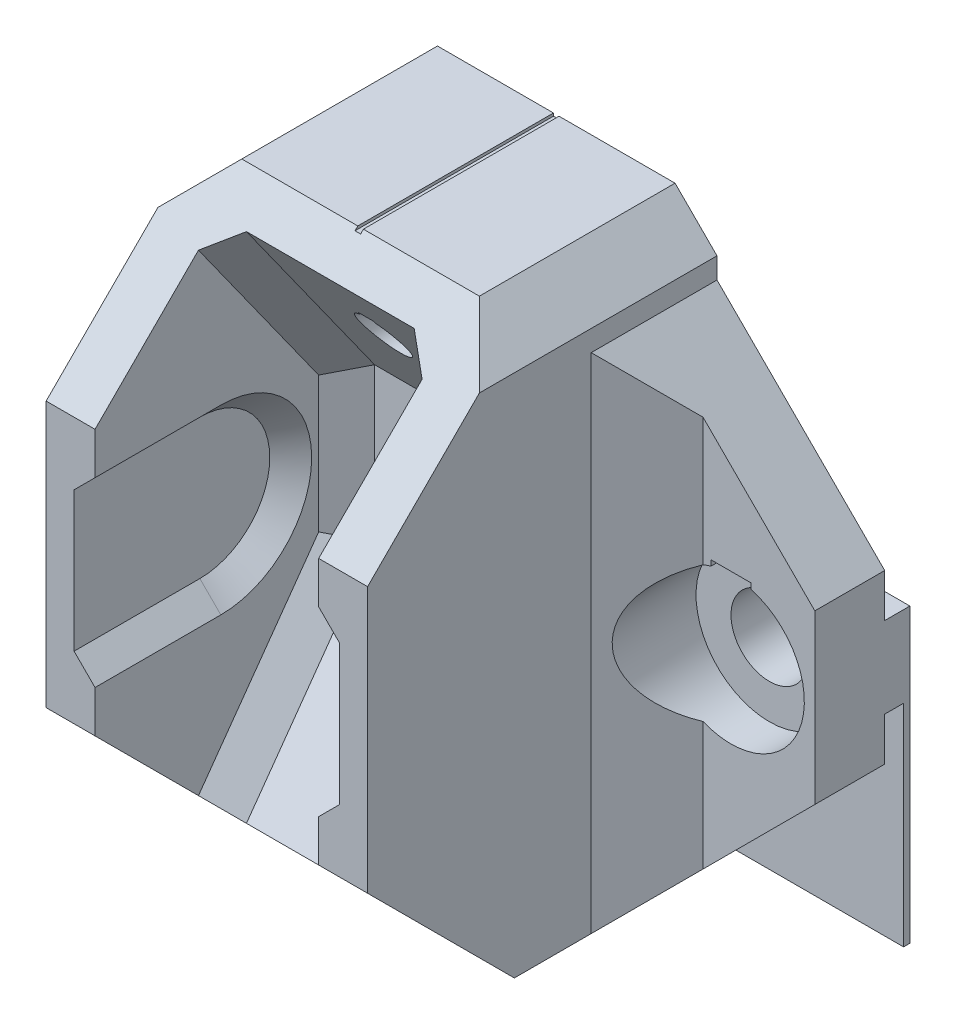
ISO-10303-21;
HEADER;
FILE_DESCRIPTION(('STEP AP214'),'2;1');
FILE_NAME('part.step','',(''),(''),'','','');
FILE_SCHEMA(('AUTOMOTIVE_DESIGN { 1 0 10303 214 1 1 1 1 }'));
ENDSEC;
DATA;
#1=APPLICATION_CONTEXT('core data for automotive mechanical design processes');
#2=APPLICATION_PROTOCOL_DEFINITION('international standard','automotive_design',2000,#1);
#3=PRODUCT_CONTEXT('',#1,'mechanical');
#4=PRODUCT('Part','Part','',(#3));
#5=PRODUCT_RELATED_PRODUCT_CATEGORY('part','',(#4));
#6=PRODUCT_DEFINITION_FORMATION('','',#4);
#7=PRODUCT_DEFINITION_CONTEXT('part definition',#1,'design');
#8=PRODUCT_DEFINITION('design','',#6,#7);
#9=PRODUCT_DEFINITION_SHAPE('','',#8);
#10=(LENGTH_UNIT() NAMED_UNIT(*) SI_UNIT(.MILLI.,.METRE.));
#11=(NAMED_UNIT(*) PLANE_ANGLE_UNIT() SI_UNIT($,.RADIAN.));
#12=(NAMED_UNIT(*) SI_UNIT($,.STERADIAN.) SOLID_ANGLE_UNIT());
#13=UNCERTAINTY_MEASURE_WITH_UNIT(LENGTH_MEASURE(1.E-05),#10,'distance_accuracy_value','');
#14=(GEOMETRIC_REPRESENTATION_CONTEXT(3) GLOBAL_UNCERTAINTY_ASSIGNED_CONTEXT((#13)) GLOBAL_UNIT_ASSIGNED_CONTEXT((#10,
#11,#12)) REPRESENTATION_CONTEXT('',''));
#15=CARTESIAN_POINT('',(0.,0.,0.));
#16=DIRECTION('',(0.,0.,1.));
#17=DIRECTION('',(1.,0.,0.));
#18=AXIS2_PLACEMENT_3D('',#15,#16,#17);
#19=CARTESIAN_POINT('',(-23.5,-4.9,55.6627475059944));
#20=DIRECTION('',(0.,-1.,0.));
#21=DIRECTION('',(0.,0.,-1.));
#22=AXIS2_PLACEMENT_3D('',#19,#20,#21);
#23=PLANE('',#22);
#24=DIRECTION('',(0.,0.,-1.));
#25=VECTOR('',#24,1.);
#26=CARTESIAN_POINT('',(-23.5,-4.9,55.6627475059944));
#27=LINE('',#26,#25);
#28=CARTESIAN_POINT('',(-23.5,-4.9,-7.00000000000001));
#29=VERTEX_POINT('',#28);
#30=CARTESIAN_POINT('',(-23.5,-4.9,-8.35));
#31=VERTEX_POINT('',#30);
#32=EDGE_CURVE('E62',#29,#31,#27,.T.);
#33=ORIENTED_EDGE('',*,*,#32,.T.);
#34=DIRECTION('',(-1.,0.,0.));
#35=VECTOR('',#34,1.);
#36=CARTESIAN_POINT('',(-23.5,-4.9,-8.35));
#37=LINE('',#36,#35);
#38=CARTESIAN_POINT('',(23.5,-4.9,-8.35));
#39=VERTEX_POINT('',#38);
#40=EDGE_CURVE('E57',#39,#31,#37,.T.);
#41=ORIENTED_EDGE('',*,*,#40,.F.);
#42=DIRECTION('',(0.,0.,-1.));
#43=VECTOR('',#42,1.);
#44=CARTESIAN_POINT('',(23.5,-4.9,55.6627475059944));
#45=LINE('',#44,#43);
#46=CARTESIAN_POINT('',(23.5,-4.9,-7.00000000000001));
#47=VERTEX_POINT('',#46);
#48=EDGE_CURVE('E574',#47,#39,#45,.T.);
#49=ORIENTED_EDGE('',*,*,#48,.F.);
#50=DIRECTION('',(-1.,0.,0.));
#51=VECTOR('',#50,1.);
#52=CARTESIAN_POINT('',(-23.5,-4.9,-7.00000000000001));
#53=LINE('',#52,#51);
#54=EDGE_CURVE('E694',#47,#29,#53,.T.);
#55=ORIENTED_EDGE('',*,*,#54,.T.);
#56=EDGE_LOOP('',(#33,#41,#49,#55));
#57=FACE_BOUND('',#56,.T.);
#58=ADVANCED_FACE('F42',(#57),#23,.T.);
#59=CARTESIAN_POINT('',(-23.5,4.,-2.));
#60=DIRECTION('',(0.,0.,1.));
#61=DIRECTION('',(1.,0.,0.));
#62=AXIS2_PLACEMENT_3D('',#59,#60,#61);
#63=PLANE('',#62);
#64=CARTESIAN_POINT('',(-17.5,-2.,-2.));
#65=DIRECTION('',(0.,0.,1.));
#66=DIRECTION('',(1.,0.,0.));
#67=AXIS2_PLACEMENT_3D('',#64,#65,#66);
#68=CIRCLE('',#67,5.24999999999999);
#69=CARTESIAN_POINT('',(-18.9352700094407,3.04999999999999,-2.00000000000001));
#70=VERTEX_POINT('',#69);
#71=CARTESIAN_POINT('',(-15.5,-6.8541219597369,-2.));
#72=VERTEX_POINT('',#71);
#73=EDGE_CURVE('E721',#70,#72,#68,.T.);
#74=ORIENTED_EDGE('',*,*,#73,.F.);
#75=DIRECTION('',(0.,1.,0.));
#76=VECTOR('',#75,1.);
#77=CARTESIAN_POINT('',(-18.9352700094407,4.,-2.));
#78=LINE('',#77,#76);
#79=CARTESIAN_POINT('',(-18.9352700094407,3.44999999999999,-2.));
#80=VERTEX_POINT('',#79);
#81=EDGE_CURVE('E615',#70,#80,#78,.T.);
#82=ORIENTED_EDGE('',*,*,#81,.T.);
#83=DIRECTION('',(-1.,0.,0.));
#84=VECTOR('',#83,1.);
#85=CARTESIAN_POINT('',(-23.5,3.44999999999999,-2.));
#86=LINE('',#85,#84);
#87=CARTESIAN_POINT('',(-16.0647299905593,3.44999999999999,-2.));
#88=VERTEX_POINT('',#87);
#89=EDGE_CURVE('E1194',#88,#80,#86,.T.);
#90=ORIENTED_EDGE('',*,*,#89,.F.);
#91=DIRECTION('',(0.,1.,0.));
#92=VECTOR('',#91,1.);
#93=CARTESIAN_POINT('',(-16.0647299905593,4.,-2.));
#94=LINE('',#93,#92);
#95=CARTESIAN_POINT('',(-16.0647299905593,3.04999999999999,-2.00000000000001));
#96=VERTEX_POINT('',#95);
#97=EDGE_CURVE('E612',#96,#88,#94,.T.);
#98=ORIENTED_EDGE('',*,*,#97,.F.);
#99=CARTESIAN_POINT('',(-15.5,2.8541219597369,-2.));
#100=VERTEX_POINT('',#99);
#101=EDGE_CURVE('E722',#100,#96,#68,.T.);
#102=ORIENTED_EDGE('',*,*,#101,.F.);
#103=DIRECTION('',(0.,1.,0.));
#104=VECTOR('',#103,1.);
#105=CARTESIAN_POINT('',(-15.5,4.,-2.));
#106=LINE('',#105,#104);
#107=CARTESIAN_POINT('',(-15.5,12.,-2.));
#108=VERTEX_POINT('',#107);
#109=EDGE_CURVE('E1055',#100,#108,#106,.T.);
#110=ORIENTED_EDGE('',*,*,#109,.T.);
#111=DIRECTION('',(-0.707106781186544,-0.707106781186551,0.));
#112=VECTOR('',#111,1.);
#113=CARTESIAN_POINT('',(-11.5,16.0000000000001,-2.));
#114=LINE('',#113,#112);
#115=CARTESIAN_POINT('',(-23.5,4.,-2.));
#116=VERTEX_POINT('',#115);
#117=EDGE_CURVE('E1040',#108,#116,#114,.T.);
#118=ORIENTED_EDGE('',*,*,#117,.T.);
#119=DIRECTION('',(0.,-1.,0.));
#120=VECTOR('',#119,1.);
#121=CARTESIAN_POINT('',(-23.5,4.,-2.));
#122=LINE('',#121,#120);
#123=CARTESIAN_POINT('',(-23.5,-8.,-2.));
#124=VERTEX_POINT('',#123);
#125=EDGE_CURVE('E739',#116,#124,#122,.T.);
#126=ORIENTED_EDGE('',*,*,#125,.T.);
#127=DIRECTION('',(0.707106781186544,-0.707106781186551,0.));
#128=VECTOR('',#127,1.);
#129=CARTESIAN_POINT('',(-11.5,-20.0000000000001,-2.));
#130=LINE('',#129,#128);
#131=CARTESIAN_POINT('',(-15.5,-16.,-2.));
#132=VERTEX_POINT('',#131);
#133=EDGE_CURVE('E1037',#124,#132,#130,.T.);
#134=ORIENTED_EDGE('',*,*,#133,.T.);
#135=DIRECTION('',(0.,1.,0.));
#136=VECTOR('',#135,1.);
#137=CARTESIAN_POINT('',(-15.5,4.,-2.));
#138=LINE('',#137,#136);
#139=EDGE_CURVE('E1057',#132,#72,#138,.T.);
#140=ORIENTED_EDGE('',*,*,#139,.T.);
#141=EDGE_LOOP('',(#74,#82,#90,#98,#102,#110,#118,#126,#134,#140));
#142=FACE_BOUND('',#141,.T.);
#143=ADVANCED_FACE('F1228',(#142),#63,.T.);
#144=CARTESIAN_POINT('',(-17.5,-2.,-2.));
#145=DIRECTION('',(0.,0.,1.));
#146=DIRECTION('',(1.,0.,0.));
#147=AXIS2_PLACEMENT_3D('',#144,#145,#146);
#148=CYLINDRICAL_SURFACE('',#147,5.25);
#149=DIRECTION('',(0.,0.,1.));
#150=VECTOR('',#149,1.);
#151=CARTESIAN_POINT('',(-18.9352700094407,3.04999999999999,-2.));
#152=LINE('',#151,#150);
#153=CARTESIAN_POINT('',(-18.9352700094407,3.04999999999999,-4.75));
#154=VERTEX_POINT('',#153);
#155=EDGE_CURVE('E1191',#70,#154,#152,.F.);
#156=ORIENTED_EDGE('',*,*,#155,.F.);
#157=ORIENTED_EDGE('',*,*,#73,.T.);
#158=CARTESIAN_POINT('',(-17.5,-2.,-4.));
#159=DIRECTION('',(0.707106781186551,0.,-0.707106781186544));
#160=DIRECTION('',(0.707106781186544,0.,0.707106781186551));
#161=AXIS2_PLACEMENT_3D('',#158,#159,#160);
#162=ELLIPSE('',#161,7.42462120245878,5.25);
#163=EDGE_CURVE('E1069',#72,#100,#162,.F.);
#164=ORIENTED_EDGE('',*,*,#163,.T.);
#165=ORIENTED_EDGE('',*,*,#101,.T.);
#166=DIRECTION('',(0.,0.,1.));
#167=VECTOR('',#166,1.);
#168=CARTESIAN_POINT('',(-16.0647299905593,3.05,-2.));
#169=LINE('',#168,#167);
#170=CARTESIAN_POINT('',(-16.0647299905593,3.04999999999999,-4.75));
#171=VERTEX_POINT('',#170);
#172=EDGE_CURVE('E1188',#96,#171,#169,.F.);
#173=ORIENTED_EDGE('',*,*,#172,.T.);
#174=CARTESIAN_POINT('',(-17.5,-2.,-4.75));
#175=DIRECTION('',(0.,0.,1.));
#176=DIRECTION('',(1.,0.,0.));
#177=AXIS2_PLACEMENT_3D('',#174,#175,#176);
#178=CIRCLE('',#177,5.25);
#179=EDGE_CURVE('E725',#154,#171,#178,.T.);
#180=ORIENTED_EDGE('',*,*,#179,.F.);
#181=EDGE_LOOP('',(#156,#157,#164,#165,#173,#180));
#182=FACE_BOUND('',#181,.T.);
#183=ADVANCED_FACE('F1233',(#182),#148,.F.);
#184=CARTESIAN_POINT('',(-21.2672923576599,1.,-8.8));
#185=DIRECTION('',(0.,0.,-1.));
#186=DIRECTION('',(-1.,0.,0.));
#187=AXIS2_PLACEMENT_3D('',#184,#185,#186);
#188=PLANE('',#187);
#189=DIRECTION('',(0.,-1.,0.));
#190=VECTOR('',#189,1.);
#191=CARTESIAN_POINT('',(-18.234846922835,0.849999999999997,-8.8));
#192=LINE('',#191,#190);
#193=CARTESIAN_POINT('',(-18.234846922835,0.849999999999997,-8.8));
#194=VERTEX_POINT('',#193);
#195=CARTESIAN_POINT('',(-18.234846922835,0.649999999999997,-8.8));
#196=VERTEX_POINT('',#195);
#197=EDGE_CURVE('E583',#194,#196,#192,.T.);
#198=ORIENTED_EDGE('',*,*,#197,.T.);
#199=CARTESIAN_POINT('',(-17.5,-2.,-8.8));
#200=DIRECTION('',(0.,0.,1.));
#201=DIRECTION('',(1.,0.,0.));
#202=AXIS2_PLACEMENT_3D('',#199,#200,#201);
#203=CIRCLE('',#202,2.75);
#204=CARTESIAN_POINT('',(-16.765153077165,0.649999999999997,-8.8));
#205=VERTEX_POINT('',#204);
#206=EDGE_CURVE('E731',#196,#205,#203,.T.);
#207=ORIENTED_EDGE('',*,*,#206,.T.);
#208=DIRECTION('',(0.,-1.,0.));
#209=VECTOR('',#208,1.);
#210=CARTESIAN_POINT('',(-16.765153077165,0.849999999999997,-8.8));
#211=LINE('',#210,#209);
#212=CARTESIAN_POINT('',(-16.765153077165,0.849999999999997,-8.8));
#213=VERTEX_POINT('',#212);
#214=EDGE_CURVE('E589',#213,#205,#211,.T.);
#215=ORIENTED_EDGE('',*,*,#214,.F.);
#216=DIRECTION('',(1.,0.,0.));
#217=VECTOR('',#216,1.);
#218=CARTESIAN_POINT('',(-18.234846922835,0.849999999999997,-8.8));
#219=LINE('',#218,#217);
#220=EDGE_CURVE('E586',#194,#213,#219,.T.);
#221=ORIENTED_EDGE('',*,*,#220,.F.);
#222=EDGE_LOOP('',(#198,#207,#215,#221));
#223=FACE_BOUND('',#222,.T.);
#224=DIRECTION('',(0.,1.,0.));
#225=VECTOR('',#224,1.);
#226=CARTESIAN_POINT('',(-23.5,-5.,-8.8));
#227=LINE('',#226,#225);
#228=CARTESIAN_POINT('',(-23.5,-20.0000000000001,-8.8));
#229=VERTEX_POINT('',#228);
#230=CARTESIAN_POINT('',(-23.5,0.899999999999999,-8.8));
#231=VERTEX_POINT('',#230);
#232=EDGE_CURVE('E748',#229,#231,#227,.T.);
#233=ORIENTED_EDGE('',*,*,#232,.T.);
#234=DIRECTION('',(1.,0.,0.));
#235=VECTOR('',#234,1.);
#236=CARTESIAN_POINT('',(-23.5,0.899999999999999,-8.8));
#237=LINE('',#236,#235);
#238=CARTESIAN_POINT('',(23.5,0.899999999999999,-8.8));
#239=VERTEX_POINT('',#238);
#240=EDGE_CURVE('E687',#231,#239,#237,.T.);
#241=ORIENTED_EDGE('',*,*,#240,.T.);
#242=DIRECTION('',(0.,1.,0.));
#243=VECTOR('',#242,1.);
#244=CARTESIAN_POINT('',(23.5,-5.,-8.8));
#245=LINE('',#244,#243);
#246=CARTESIAN_POINT('',(23.5,-20.0000000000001,-8.8));
#247=VERTEX_POINT('',#246);
#248=EDGE_CURVE('E764',#247,#239,#245,.T.);
#249=ORIENTED_EDGE('',*,*,#248,.F.);
#250=DIRECTION('',(-1.,0.,0.));
#251=VECTOR('',#250,1.);
#252=CARTESIAN_POINT('',(-23.5,-20.0000000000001,-8.8));
#253=LINE('',#252,#251);
#254=EDGE_CURVE('E566',#247,#229,#253,.T.);
#255=ORIENTED_EDGE('',*,*,#254,.T.);
#256=EDGE_LOOP('',(#233,#241,#249,#255));
#257=FACE_BOUND('',#256,.T.);
#258=CARTESIAN_POINT('',(17.5,-2.,-8.8));
#259=DIRECTION('',(0.,0.,1.));
#260=DIRECTION('',(1.,0.,0.));
#261=AXIS2_PLACEMENT_3D('',#258,#259,#260);
#262=CIRCLE('',#261,2.75);
#263=CARTESIAN_POINT('',(16.765153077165,0.649999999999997,-8.8));
#264=VERTEX_POINT('',#263);
#265=CARTESIAN_POINT('',(18.234846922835,0.649999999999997,-8.8));
#266=VERTEX_POINT('',#265);
#267=EDGE_CURVE('E761',#264,#266,#262,.T.);
#268=ORIENTED_EDGE('',*,*,#267,.T.);
#269=DIRECTION('',(0.,-1.,0.));
#270=VECTOR('',#269,1.);
#271=CARTESIAN_POINT('',(18.234846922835,0.849999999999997,-8.8));
#272=LINE('',#271,#270);
#273=CARTESIAN_POINT('',(18.234846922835,0.849999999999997,-8.8));
#274=VERTEX_POINT('',#273);
#275=EDGE_CURVE('E618',#274,#266,#272,.T.);
#276=ORIENTED_EDGE('',*,*,#275,.F.);
#277=DIRECTION('',(-1.,0.,0.));
#278=VECTOR('',#277,1.);
#279=CARTESIAN_POINT('',(18.234846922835,0.849999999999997,-8.8));
#280=LINE('',#279,#278);
#281=CARTESIAN_POINT('',(16.765153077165,0.849999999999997,-8.8));
#282=VERTEX_POINT('',#281);
#283=EDGE_CURVE('E623',#274,#282,#280,.T.);
#284=ORIENTED_EDGE('',*,*,#283,.T.);
#285=DIRECTION('',(0.,-1.,0.));
#286=VECTOR('',#285,1.);
#287=CARTESIAN_POINT('',(16.765153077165,0.849999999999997,-8.8));
#288=LINE('',#287,#286);
#289=EDGE_CURVE('E620',#282,#264,#288,.T.);
#290=ORIENTED_EDGE('',*,*,#289,.T.);
#291=EDGE_LOOP('',(#268,#276,#284,#290));
#292=FACE_BOUND('',#291,.T.);
#293=ADVANCED_FACE('F1214',(#223,#257,#292),#188,.T.);
#294=CARTESIAN_POINT('',(17.5,-2.,-2.));
#295=DIRECTION('',(0.,0.,1.));
#296=DIRECTION('',(1.,0.,0.));
#297=AXIS2_PLACEMENT_3D('',#294,#295,#296);
#298=CYLINDRICAL_SURFACE('',#297,2.75);
#299=DIRECTION('',(0.,0.,1.));
#300=VECTOR('',#299,1.);
#301=CARTESIAN_POINT('',(18.234846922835,0.649999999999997,-8.8));
#302=LINE('',#301,#300);
#303=CARTESIAN_POINT('',(18.234846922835,0.649999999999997,-4.75));
#304=VERTEX_POINT('',#303);
#305=EDGE_CURVE('E634',#266,#304,#302,.T.);
#306=ORIENTED_EDGE('',*,*,#305,.F.);
#307=ORIENTED_EDGE('',*,*,#267,.F.);
#308=DIRECTION('',(0.,0.,1.));
#309=VECTOR('',#308,1.);
#310=CARTESIAN_POINT('',(16.765153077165,0.649999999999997,-8.8));
#311=LINE('',#310,#309);
#312=CARTESIAN_POINT('',(16.765153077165,0.649999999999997,-4.75));
#313=VERTEX_POINT('',#312);
#314=EDGE_CURVE('E631',#264,#313,#311,.T.);
#315=ORIENTED_EDGE('',*,*,#314,.T.);
#316=CARTESIAN_POINT('',(17.5,-2.,-4.75));
#317=DIRECTION('',(0.,0.,1.));
#318=DIRECTION('',(1.,0.,0.));
#319=AXIS2_PLACEMENT_3D('',#316,#317,#318);
#320=CIRCLE('',#319,2.75);
#321=EDGE_CURVE('E758',#313,#304,#320,.T.);
#322=ORIENTED_EDGE('',*,*,#321,.T.);
#323=EDGE_LOOP('',(#306,#307,#315,#322));
#324=FACE_BOUND('',#323,.T.);
#325=ADVANCED_FACE('F1278',(#324),#298,.F.);
#326=CARTESIAN_POINT('',(20.25,-2.,-4.75));
#327=DIRECTION('',(0.,0.,-1.));
#328=DIRECTION('',(-1.,0.,0.));
#329=AXIS2_PLACEMENT_3D('',#326,#327,#328);
#330=PLANE('',#329);
#331=CARTESIAN_POINT('',(17.5,-2.,-4.75));
#332=DIRECTION('',(0.,0.,1.));
#333=DIRECTION('',(1.,0.,0.));
#334=AXIS2_PLACEMENT_3D('',#331,#332,#333);
#335=CIRCLE('',#334,5.25);
#336=CARTESIAN_POINT('',(16.0647299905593,3.05,-4.75));
#337=VERTEX_POINT('',#336);
#338=CARTESIAN_POINT('',(18.9352700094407,3.04999999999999,-4.75));
#339=VERTEX_POINT('',#338);
#340=EDGE_CURVE('E755',#337,#339,#335,.T.);
#341=ORIENTED_EDGE('',*,*,#340,.T.);
#342=DIRECTION('',(0.,-1.,0.));
#343=VECTOR('',#342,1.);
#344=CARTESIAN_POINT('',(18.9352700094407,3.44999999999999,-4.75));
#345=LINE('',#344,#343);
#346=CARTESIAN_POINT('',(18.9352700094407,3.44999999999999,-4.75));
#347=VERTEX_POINT('',#346);
#348=EDGE_CURVE('E636',#347,#339,#345,.T.);
#349=ORIENTED_EDGE('',*,*,#348,.F.);
#350=DIRECTION('',(-1.,0.,0.));
#351=VECTOR('',#350,1.);
#352=CARTESIAN_POINT('',(18.9352700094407,3.44999999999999,-4.75));
#353=LINE('',#352,#351);
#354=CARTESIAN_POINT('',(16.0647299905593,3.44999999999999,-4.75));
#355=VERTEX_POINT('',#354);
#356=EDGE_CURVE('E640',#347,#355,#353,.T.);
#357=ORIENTED_EDGE('',*,*,#356,.T.);
#358=DIRECTION('',(0.,-1.,0.));
#359=VECTOR('',#358,1.);
#360=CARTESIAN_POINT('',(16.0647299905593,3.44999999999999,-4.75));
#361=LINE('',#360,#359);
#362=EDGE_CURVE('E638',#355,#337,#361,.T.);
#363=ORIENTED_EDGE('',*,*,#362,.T.);
#364=EDGE_LOOP('',(#341,#349,#357,#363));
#365=FACE_BOUND('',#364,.T.);
#366=DIRECTION('',(0.,1.,0.));
#367=VECTOR('',#366,1.);
#368=CARTESIAN_POINT('',(18.234846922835,-2.,-4.75));
#369=LINE('',#368,#367);
#370=CARTESIAN_POINT('',(18.234846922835,0.849999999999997,-4.75));
#371=VERTEX_POINT('',#370);
#372=EDGE_CURVE('E1185',#304,#371,#369,.T.);
#373=ORIENTED_EDGE('',*,*,#372,.F.);
#374=ORIENTED_EDGE('',*,*,#321,.F.);
#375=DIRECTION('',(0.,1.,0.));
#376=VECTOR('',#375,1.);
#377=CARTESIAN_POINT('',(16.765153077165,-1.99999999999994,-4.75));
#378=LINE('',#377,#376);
#379=CARTESIAN_POINT('',(16.765153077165,0.849999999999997,-4.75));
#380=VERTEX_POINT('',#379);
#381=EDGE_CURVE('E1182',#313,#380,#378,.T.);
#382=ORIENTED_EDGE('',*,*,#381,.T.);
#383=DIRECTION('',(1.,0.,0.));
#384=VECTOR('',#383,1.);
#385=CARTESIAN_POINT('',(20.25,0.849999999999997,-4.75));
#386=LINE('',#385,#384);
#387=EDGE_CURVE('E1179',#380,#371,#386,.T.);
#388=ORIENTED_EDGE('',*,*,#387,.T.);
#389=EDGE_LOOP('',(#373,#374,#382,#388));
#390=FACE_BOUND('',#389,.T.);
#391=ADVANCED_FACE('F1274',(#365,#390),#330,.F.);
#392=CARTESIAN_POINT('',(-11.5,20.5,-7.));
#393=DIRECTION('',(0.,-1.,0.));
#394=DIRECTION('',(0.,0.,-1.));
#395=AXIS2_PLACEMENT_3D('',#392,#393,#394);
#396=PLANE('',#395);
#397=DIRECTION('',(-1.,0.,0.));
#398=VECTOR('',#397,1.);
#399=CARTESIAN_POINT('',(8.,20.5,6.99999999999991));
#400=LINE('',#399,#398);
#401=CARTESIAN_POINT('',(-8.49999999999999,20.5,6.99999999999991));
#402=VERTEX_POINT('',#401);
#403=CARTESIAN_POINT('',(-0.200000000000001,20.5,6.99999999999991));
#404=VERTEX_POINT('',#403);
#405=EDGE_CURVE('E1119',#402,#404,#400,.F.);
#406=ORIENTED_EDGE('',*,*,#405,.T.);
#407=DIRECTION('',(0.,0.,-1.));
#408=VECTOR('',#407,1.);
#409=CARTESIAN_POINT('',(-0.200000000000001,20.5,-7.));
#410=LINE('',#409,#408);
#411=CARTESIAN_POINT('',(-0.200000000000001,20.5,-7.));
#412=VERTEX_POINT('',#411);
#413=EDGE_CURVE('E715',#404,#412,#410,.T.);
#414=ORIENTED_EDGE('',*,*,#413,.T.);
#415=DIRECTION('',(1.,0.,0.));
#416=VECTOR('',#415,1.);
#417=CARTESIAN_POINT('',(-11.5,20.5,-7.));
#418=LINE('',#417,#416);
#419=CARTESIAN_POINT('',(-8.49999999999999,20.5,-7.));
#420=VERTEX_POINT('',#419);
#421=EDGE_CURVE('E1115',#420,#412,#418,.T.);
#422=ORIENTED_EDGE('',*,*,#421,.F.);
#423=DIRECTION('',(0.,0.,1.));
#424=VECTOR('',#423,1.);
#425=CARTESIAN_POINT('',(-8.49999999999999,20.5,-7.));
#426=LINE('',#425,#424);
#427=EDGE_CURVE('E1130',#420,#402,#426,.T.);
#428=ORIENTED_EDGE('',*,*,#427,.T.);
#429=EDGE_LOOP('',(#406,#414,#422,#428));
#430=FACE_BOUND('',#429,.T.);
#431=ADVANCED_FACE('F1277',(#430),#396,.F.);
#432=CARTESIAN_POINT('',(8.,-19.5,18.));
#433=DIRECTION('',(0.,0.,-1.));
#434=DIRECTION('',(0.,1.,0.));
#435=AXIS2_PLACEMENT_3D('',#432,#433,#434);
#436=PLANE('',#435);
#437=DIRECTION('',(0.,-1.,0.));
#438=VECTOR('',#437,1.);
#439=CARTESIAN_POINT('',(-11.5,21.5,18.));
#440=LINE('',#439,#438);
#441=CARTESIAN_POINT('',(-11.5,9.49999999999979,18.));
#442=VERTEX_POINT('',#441);
#443=CARTESIAN_POINT('',(-11.5,-9.49999999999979,18.));
#444=VERTEX_POINT('',#443);
#445=EDGE_CURVE('E999',#442,#444,#440,.T.);
#446=ORIENTED_EDGE('',*,*,#445,.T.);
#447=DIRECTION('',(1.,0.,0.));
#448=VECTOR('',#447,1.);
#449=CARTESIAN_POINT('',(8.,-9.49999999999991,18.));
#450=LINE('',#449,#448);
#451=CARTESIAN_POINT('',(-8.,-9.49999999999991,18.));
#452=VERTEX_POINT('',#451);
#453=EDGE_CURVE('E1081',#444,#452,#450,.T.);
#454=ORIENTED_EDGE('',*,*,#453,.T.);
#455=DIRECTION('',(0.,-1.,0.));
#456=VECTOR('',#455,1.);
#457=CARTESIAN_POINT('',(-8.,-19.5,18.));
#458=LINE('',#457,#456);
#459=CARTESIAN_POINT('',(-8.,-6.5,18.));
#460=VERTEX_POINT('',#459);
#461=EDGE_CURVE('E893',#460,#452,#458,.T.);
#462=ORIENTED_EDGE('',*,*,#461,.F.);
#463=DIRECTION('',(0.707106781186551,-0.707106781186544,0.));
#464=VECTOR('',#463,1.);
#465=CARTESIAN_POINT('',(6.50000000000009,-20.9999999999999,18.));
#466=LINE('',#465,#464);
#467=CARTESIAN_POINT('',(-9.5,-5.,18.));
#468=VERTEX_POINT('',#467);
#469=EDGE_CURVE('E899',#468,#460,#466,.T.);
#470=ORIENTED_EDGE('',*,*,#469,.F.);
#471=DIRECTION('',(0.,-1.,0.));
#472=VECTOR('',#471,1.);
#473=CARTESIAN_POINT('',(-9.5,0.,18.));
#474=LINE('',#473,#472);
#475=CARTESIAN_POINT('',(-9.5,5.,18.));
#476=VERTEX_POINT('',#475);
#477=EDGE_CURVE('E896',#476,#468,#474,.T.);
#478=ORIENTED_EDGE('',*,*,#477,.F.);
#479=DIRECTION('',(0.707106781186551,0.707106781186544,0.));
#480=VECTOR('',#479,1.);
#481=CARTESIAN_POINT('',(-12.9999999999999,1.50000000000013,18.));
#482=LINE('',#481,#480);
#483=CARTESIAN_POINT('',(-8.,6.5,18.));
#484=VERTEX_POINT('',#483);
#485=EDGE_CURVE('E892',#484,#476,#482,.F.);
#486=ORIENTED_EDGE('',*,*,#485,.F.);
#487=CARTESIAN_POINT('',(-8.,9.49999999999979,18.));
#488=VERTEX_POINT('',#487);
#489=EDGE_CURVE('E890',#488,#484,#458,.T.);
#490=ORIENTED_EDGE('',*,*,#489,.F.);
#491=DIRECTION('',(-1.,0.,0.));
#492=VECTOR('',#491,1.);
#493=CARTESIAN_POINT('',(8.,9.49999999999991,18.));
#494=LINE('',#493,#492);
#495=EDGE_CURVE('E1074',#488,#442,#494,.T.);
#496=ORIENTED_EDGE('',*,*,#495,.T.);
#497=EDGE_LOOP('',(#446,#454,#462,#470,#478,#486,#490,#496));
#498=FACE_BOUND('',#497,.T.);
#499=ADVANCED_FACE('F1439',(#498),#436,.F.);
#500=CARTESIAN_POINT('',(11.5,21.5,-7.));
#501=DIRECTION('',(-1.,0.,0.));
#502=DIRECTION('',(0.,0.,1.));
#503=AXIS2_PLACEMENT_3D('',#500,#501,#502);
#504=PLANE('',#503);
#505=DIRECTION('',(0.,-1.,0.));
#506=VECTOR('',#505,1.);
#507=CARTESIAN_POINT('',(11.5,21.5,-7.));
#508=LINE('',#507,#506);
#509=CARTESIAN_POINT('',(11.5,17.5,-7.));
#510=VERTEX_POINT('',#509);
#511=CARTESIAN_POINT('',(11.5,16.,-7.));
#512=VERTEX_POINT('',#511);
#513=EDGE_CURVE('E1005',#510,#512,#508,.T.);
#514=ORIENTED_EDGE('',*,*,#513,.F.);
#515=DIRECTION('',(0.,0.,1.));
#516=VECTOR('',#515,1.);
#517=CARTESIAN_POINT('',(11.5,17.5,-7.));
#518=LINE('',#517,#516);
#519=CARTESIAN_POINT('',(11.5,17.5,9.99999999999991));
#520=VERTEX_POINT('',#519);
#521=EDGE_CURVE('E1122',#510,#520,#518,.T.);
#522=ORIENTED_EDGE('',*,*,#521,.T.);
#523=DIRECTION('',(0.,0.707106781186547,-0.707106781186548));
#524=VECTOR('',#523,1.);
#525=CARTESIAN_POINT('',(11.5,9.49999999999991,18.));
#526=LINE('',#525,#524);
#527=CARTESIAN_POINT('',(11.5,9.49999999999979,18.));
#528=VERTEX_POINT('',#527);
#529=EDGE_CURVE('E1098',#520,#528,#526,.F.);
#530=ORIENTED_EDGE('',*,*,#529,.T.);
#531=DIRECTION('',(0.,1.,0.));
#532=VECTOR('',#531,1.);
#533=CARTESIAN_POINT('',(11.5,21.5,18.));
#534=LINE('',#533,#532);
#535=CARTESIAN_POINT('',(11.5,-9.49999999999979,18.));
#536=VERTEX_POINT('',#535);
#537=EDGE_CURVE('E1002',#536,#528,#534,.T.);
#538=ORIENTED_EDGE('',*,*,#537,.F.);
#539=DIRECTION('',(0.,0.707106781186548,0.707106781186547));
#540=VECTOR('',#539,1.);
#541=CARTESIAN_POINT('',(11.5,-9.49999999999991,18.));
#542=LINE('',#541,#540);
#543=CARTESIAN_POINT('',(11.5,-20.0000000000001,7.49999999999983));
#544=VERTEX_POINT('',#543);
#545=EDGE_CURVE('E1100',#536,#544,#542,.F.);
#546=ORIENTED_EDGE('',*,*,#545,.T.);
#547=DIRECTION('',(0.,0.,1.));
#548=VECTOR('',#547,1.);
#549=CARTESIAN_POINT('',(11.5,-20.0000000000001,-7.));
#550=LINE('',#549,#548);
#551=CARTESIAN_POINT('',(11.5,-20.,2.00000000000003));
#552=VERTEX_POINT('',#551);
#553=EDGE_CURVE('E1020',#552,#544,#550,.T.);
#554=ORIENTED_EDGE('',*,*,#553,.F.);
#555=DIRECTION('',(0.,1.,0.));
#556=VECTOR('',#555,1.);
#557=CARTESIAN_POINT('',(11.5,16.,2.00000000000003));
#558=LINE('',#557,#556);
#559=CARTESIAN_POINT('',(11.5,16.,2.00000000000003));
#560=VERTEX_POINT('',#559);
#561=EDGE_CURVE('E1049',#552,#560,#558,.T.);
#562=ORIENTED_EDGE('',*,*,#561,.T.);
#563=DIRECTION('',(0.,0.,-1.));
#564=VECTOR('',#563,1.);
#565=CARTESIAN_POINT('',(11.5,16.,-7.));
#566=LINE('',#565,#564);
#567=EDGE_CURVE('E1016',#560,#512,#566,.T.);
#568=ORIENTED_EDGE('',*,*,#567,.T.);
#569=EDGE_LOOP('',(#514,#522,#530,#538,#546,#554,#562,#568));
#570=FACE_BOUND('',#569,.T.);
#571=ADVANCED_FACE('F1446',(#570),#504,.F.);
#572=CARTESIAN_POINT('',(0.,0.,-7.));
#573=DIRECTION('',(0.,0.,1.));
#574=DIRECTION('',(1.,0.,0.));
#575=AXIS2_PLACEMENT_3D('',#572,#573,#574);
#576=PLANE('',#575);
#577=ORIENTED_EDGE('',*,*,#421,.T.);
#578=DIRECTION('',(0.,-1.,0.));
#579=VECTOR('',#578,1.);
#580=CARTESIAN_POINT('',(-0.200000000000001,0.,-7.));
#581=LINE('',#580,#579);
#582=CARTESIAN_POINT('',(-0.200000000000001,20.3,-7.));
#583=VERTEX_POINT('',#582);
#584=EDGE_CURVE('E718',#412,#583,#581,.T.);
#585=ORIENTED_EDGE('',*,*,#584,.T.);
#586=DIRECTION('',(1.,0.,0.));
#587=VECTOR('',#586,1.);
#588=CARTESIAN_POINT('',(0.,20.3,-7.));
#589=LINE('',#588,#587);
#590=CARTESIAN_POINT('',(0.199999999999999,20.3,-7.));
#591=VERTEX_POINT('',#590);
#592=EDGE_CURVE('E705',#583,#591,#589,.T.);
#593=ORIENTED_EDGE('',*,*,#592,.T.);
#594=DIRECTION('',(0.,1.,0.));
#595=VECTOR('',#594,1.);
#596=CARTESIAN_POINT('',(0.200000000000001,0.,-7.));
#597=LINE('',#596,#595);
#598=CARTESIAN_POINT('',(0.199999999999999,20.5,-7.));
#599=VERTEX_POINT('',#598);
#600=EDGE_CURVE('E712',#591,#599,#597,.T.);
#601=ORIENTED_EDGE('',*,*,#600,.T.);
#602=CARTESIAN_POINT('',(8.49999999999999,20.5,-7.));
#603=VERTEX_POINT('',#602);
#604=EDGE_CURVE('E1011',#599,#603,#418,.T.);
#605=ORIENTED_EDGE('',*,*,#604,.T.);
#606=DIRECTION('',(-0.707106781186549,0.707106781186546,0.));
#607=VECTOR('',#606,1.);
#608=CARTESIAN_POINT('',(11.5,17.5,-7.));
#609=LINE('',#608,#607);
#610=EDGE_CURVE('E1138',#603,#510,#609,.F.);
#611=ORIENTED_EDGE('',*,*,#610,.T.);
#612=ORIENTED_EDGE('',*,*,#513,.T.);
#613=DIRECTION('',(-0.707106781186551,0.707106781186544,0.));
#614=VECTOR('',#613,1.);
#615=CARTESIAN_POINT('',(13.7499999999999,13.7500000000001,-7.));
#616=LINE('',#615,#614);
#617=CARTESIAN_POINT('',(23.5,4.,-7.));
#618=VERTEX_POINT('',#617);
#619=EDGE_CURVE('E1033',#512,#618,#616,.F.);
#620=ORIENTED_EDGE('',*,*,#619,.T.);
#621=DIRECTION('',(0.,1.,0.));
#622=VECTOR('',#621,1.);
#623=CARTESIAN_POINT('',(23.5,4.,-7.));
#624=LINE('',#623,#622);
#625=CARTESIAN_POINT('',(23.5,0.899999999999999,-7.00000000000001));
#626=VERTEX_POINT('',#625);
#627=EDGE_CURVE('E766',#626,#618,#624,.T.);
#628=ORIENTED_EDGE('',*,*,#627,.F.);
#629=DIRECTION('',(1.,0.,0.));
#630=VECTOR('',#629,1.);
#631=CARTESIAN_POINT('',(-23.5,0.899999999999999,-7.00000000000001));
#632=LINE('',#631,#630);
#633=CARTESIAN_POINT('',(-23.5,0.899999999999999,-7.));
#634=VERTEX_POINT('',#633);
#635=EDGE_CURVE('E691',#634,#626,#632,.T.);
#636=ORIENTED_EDGE('',*,*,#635,.F.);
#637=DIRECTION('',(0.,1.,0.));
#638=VECTOR('',#637,1.);
#639=CARTESIAN_POINT('',(-23.5,4.,-7.));
#640=LINE('',#639,#638);
#641=CARTESIAN_POINT('',(-23.5,4.,-7.));
#642=VERTEX_POINT('',#641);
#643=EDGE_CURVE('E745',#634,#642,#640,.T.);
#644=ORIENTED_EDGE('',*,*,#643,.T.);
#645=DIRECTION('',(0.707106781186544,0.707106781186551,0.));
#646=VECTOR('',#645,1.);
#647=CARTESIAN_POINT('',(-13.7500000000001,13.75,-7.));
#648=LINE('',#647,#646);
#649=CARTESIAN_POINT('',(-11.5,16.0000000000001,-7.));
#650=VERTEX_POINT('',#649);
#651=EDGE_CURVE('E1042',#642,#650,#648,.T.);
#652=ORIENTED_EDGE('',*,*,#651,.T.);
#653=DIRECTION('',(0.,1.,0.));
#654=VECTOR('',#653,1.);
#655=CARTESIAN_POINT('',(-11.5,21.5,-7.));
#656=LINE('',#655,#654);
#657=CARTESIAN_POINT('',(-11.5,17.5,-7.));
#658=VERTEX_POINT('',#657);
#659=EDGE_CURVE('E1008',#650,#658,#656,.T.);
#660=ORIENTED_EDGE('',*,*,#659,.T.);
#661=DIRECTION('',(-0.707106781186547,-0.707106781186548,0.));
#662=VECTOR('',#661,1.);
#663=CARTESIAN_POINT('',(-8.49999999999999,20.5,-7.));
#664=LINE('',#663,#662);
#665=EDGE_CURVE('E1136',#658,#420,#664,.F.);
#666=ORIENTED_EDGE('',*,*,#665,.T.);
#667=EDGE_LOOP('',(#577,#585,#593,#601,#605,#611,#612,#620,#628,#636,#644,#652,#660,#666));
#668=FACE_BOUND('',#667,.T.);
#669=DIRECTION('',(-0.866025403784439,-0.499999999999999,0.));
#670=VECTOR('',#669,1.);
#671=CARTESIAN_POINT('',(2.89999999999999,11.3256842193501,-7.));
#672=LINE('',#671,#670);
#673=CARTESIAN_POINT('',(2.89999999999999,11.3256842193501,-7.));
#674=VERTEX_POINT('',#673);
#675=CARTESIAN_POINT('',(0.,9.65136843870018,-7.));
#676=VERTEX_POINT('',#675);
#677=EDGE_CURVE('E852',#674,#676,#672,.T.);
#678=ORIENTED_EDGE('',*,*,#677,.F.);
#679=DIRECTION('',(0.,-1.,0.));
#680=VECTOR('',#679,1.);
#681=CARTESIAN_POINT('',(2.89999999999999,14.6743157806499,-7.));
#682=LINE('',#681,#680);
#683=CARTESIAN_POINT('',(2.89999999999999,14.6743157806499,-7.));
#684=VERTEX_POINT('',#683);
#685=EDGE_CURVE('E780',#684,#674,#682,.T.);
#686=ORIENTED_EDGE('',*,*,#685,.F.);
#687=DIRECTION('',(0.866025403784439,-0.5,0.));
#688=VECTOR('',#687,1.);
#689=CARTESIAN_POINT('',(0.,16.3486315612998,-7.));
#690=LINE('',#689,#688);
#691=CARTESIAN_POINT('',(0.,16.3486315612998,-7.));
#692=VERTEX_POINT('',#691);
#693=EDGE_CURVE('E835',#692,#684,#690,.T.);
#694=ORIENTED_EDGE('',*,*,#693,.F.);
#695=DIRECTION('',(0.866025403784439,0.5,0.));
#696=VECTOR('',#695,1.);
#697=CARTESIAN_POINT('',(-2.9,14.6743157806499,-7.));
#698=LINE('',#697,#696);
#699=CARTESIAN_POINT('',(-2.9,14.6743157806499,-7.));
#700=VERTEX_POINT('',#699);
#701=EDGE_CURVE('E861',#700,#692,#698,.T.);
#702=ORIENTED_EDGE('',*,*,#701,.F.);
#703=DIRECTION('',(0.,1.,0.));
#704=VECTOR('',#703,1.);
#705=CARTESIAN_POINT('',(-2.9,11.3256842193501,-7.));
#706=LINE('',#705,#704);
#707=CARTESIAN_POINT('',(-2.9,11.3256842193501,-7.));
#708=VERTEX_POINT('',#707);
#709=EDGE_CURVE('E858',#708,#700,#706,.T.);
#710=ORIENTED_EDGE('',*,*,#709,.F.);
#711=DIRECTION('',(-0.866025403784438,0.5,0.));
#712=VECTOR('',#711,1.);
#713=CARTESIAN_POINT('',(0.,9.65136843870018,-7.));
#714=LINE('',#713,#712);
#715=EDGE_CURVE('E855',#676,#708,#714,.T.);
#716=ORIENTED_EDGE('',*,*,#715,.F.);
#717=EDGE_LOOP('',(#678,#686,#694,#702,#710,#716));
#718=FACE_BOUND('',#717,.T.);
#719=ADVANCED_FACE('F1358',(#668,#718),#576,.F.);
#720=CARTESIAN_POINT('',(0.,-13.,-7.));
#721=DIRECTION('',(0.,0.,-1.));
#722=DIRECTION('',(-1.,0.,0.));
#723=AXIS2_PLACEMENT_3D('',#720,#721,#722);
#724=CYLINDRICAL_SURFACE('',#723,1.7);
#725=CARTESIAN_POINT('',(0.,-13.,2.));
#726=DIRECTION('',(0.,0.,-1.));
#727=DIRECTION('',(-1.,0.,0.));
#728=AXIS2_PLACEMENT_3D('',#725,#726,#727);
#729=CIRCLE('',#728,1.7);
#730=CARTESIAN_POINT('',(-0.57445626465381,-11.4,2.));
#731=VERTEX_POINT('',#730);
#732=CARTESIAN_POINT('',(0.57445626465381,-11.4,2.));
#733=VERTEX_POINT('',#732);
#734=EDGE_CURVE('E881',#731,#733,#729,.F.);
#735=ORIENTED_EDGE('',*,*,#734,.F.);
#736=DIRECTION('',(0.,0.,1.));
#737=VECTOR('',#736,1.);
#738=CARTESIAN_POINT('',(-0.57445626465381,-11.4,-8.8));
#739=LINE('',#738,#737);
#740=CARTESIAN_POINT('',(-0.57445626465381,-11.4,4.21428571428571));
#741=VERTEX_POINT('',#740);
#742=EDGE_CURVE('E652',#731,#741,#739,.T.);
#743=ORIENTED_EDGE('',*,*,#742,.T.);
#744=CARTESIAN_POINT('',(0.,-13.,5.35714285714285));
#745=DIRECTION('',(0.,0.581238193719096,0.813733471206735));
#746=DIRECTION('',(0.,0.813733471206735,-0.581238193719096));
#747=AXIS2_PLACEMENT_3D('',#744,#745,#746);
#748=ELLIPSE('',#747,2.08913613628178,1.7);
#749=CARTESIAN_POINT('',(0.57445626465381,-11.4,4.21428571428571));
#750=VERTEX_POINT('',#749);
#751=EDGE_CURVE('E880',#741,#750,#748,.T.);
#752=ORIENTED_EDGE('',*,*,#751,.T.);
#753=DIRECTION('',(0.,0.,1.));
#754=VECTOR('',#753,1.);
#755=CARTESIAN_POINT('',(0.57445626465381,-11.4,-8.8));
#756=LINE('',#755,#754);
#757=EDGE_CURVE('E671',#733,#750,#756,.T.);
#758=ORIENTED_EDGE('',*,*,#757,.F.);
#759=EDGE_LOOP('',(#735,#743,#752,#758));
#760=FACE_BOUND('',#759,.T.);
#761=ADVANCED_FACE('F1353',(#760),#724,.F.);
#762=CARTESIAN_POINT('',(0.,13.,-7.));
#763=DIRECTION('',(0.,0.,-1.));
#764=DIRECTION('',(-1.,0.,0.));
#765=AXIS2_PLACEMENT_3D('',#762,#763,#764);
#766=CYLINDRICAL_SURFACE('',#765,1.7);
#767=CARTESIAN_POINT('',(0.,13.,2.));
#768=DIRECTION('',(0.,0.,-1.));
#769=DIRECTION('',(-1.,0.,0.));
#770=AXIS2_PLACEMENT_3D('',#767,#768,#769);
#771=CIRCLE('',#770,1.7);
#772=CARTESIAN_POINT('',(-0.574456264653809,14.6,2.));
#773=VERTEX_POINT('',#772);
#774=CARTESIAN_POINT('',(0.574456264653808,14.6,2.));
#775=VERTEX_POINT('',#774);
#776=EDGE_CURVE('E820',#773,#775,#771,.F.);
#777=ORIENTED_EDGE('',*,*,#776,.F.);
#778=DIRECTION('',(0.,0.,1.));
#779=VECTOR('',#778,1.);
#780=CARTESIAN_POINT('',(-0.574456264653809,14.6,-8.8));
#781=LINE('',#780,#779);
#782=CARTESIAN_POINT('',(-0.574456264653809,14.6,6.5));
#783=VERTEX_POINT('',#782);
#784=EDGE_CURVE('E662',#773,#783,#781,.T.);
#785=ORIENTED_EDGE('',*,*,#784,.T.);
#786=CARTESIAN_POINT('',(0.,13.,5.35714285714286));
#787=DIRECTION('',(0.,-0.581238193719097,0.813733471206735));
#788=DIRECTION('',(0.,-0.813733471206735,-0.581238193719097));
#789=AXIS2_PLACEMENT_3D('',#786,#787,#788);
#790=ELLIPSE('',#789,2.08913613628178,1.7);
#791=CARTESIAN_POINT('',(0.574456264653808,14.6,6.5));
#792=VERTEX_POINT('',#791);
#793=EDGE_CURVE('E877',#783,#792,#790,.T.);
#794=ORIENTED_EDGE('',*,*,#793,.T.);
#795=DIRECTION('',(0.,0.,1.));
#796=VECTOR('',#795,1.);
#797=CARTESIAN_POINT('',(0.574456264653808,14.6,-8.8));
#798=LINE('',#797,#796);
#799=EDGE_CURVE('E660',#775,#792,#798,.T.);
#800=ORIENTED_EDGE('',*,*,#799,.F.);
#801=EDGE_LOOP('',(#777,#785,#794,#800));
#802=FACE_BOUND('',#801,.T.);
#803=ADVANCED_FACE('F1349',(#802),#766,.F.);
#804=CARTESIAN_POINT('',(-6.00000000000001,-5.5,0.));
#805=DIRECTION('',(-0.70710678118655,-0.410997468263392,-0.575396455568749));
#806=DIRECTION('',(0.,-0.813733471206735,0.581238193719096));
#807=AXIS2_PLACEMENT_3D('',#804,#805,#806);
#808=PLANE('',#807);
#809=DIRECTION('',(0.,-0.813733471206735,0.581238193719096));
#810=VECTOR('',#809,1.);
#811=CARTESIAN_POINT('',(-8.,-18.3375236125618,11.6274669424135));
#812=LINE('',#811,#810);
#813=CARTESIAN_POINT('',(-8.,-4.85906989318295,2.00000000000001));
#814=VERTEX_POINT('',#813);
#815=CARTESIAN_POINT('',(-8.,-16.8996124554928,10.6003875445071));
#816=VERTEX_POINT('',#815);
#817=EDGE_CURVE('E932',#814,#816,#812,.T.);
#818=ORIENTED_EDGE('',*,*,#817,.T.);
#819=DIRECTION('',(-0.702246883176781,0.503413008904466,0.503413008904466));
#820=VECTOR('',#819,1.);
#821=CARTESIAN_POINT('',(-5.34141423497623,-18.8054474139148,8.69455258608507));
#822=LINE('',#821,#820);
#823=CARTESIAN_POINT('',(-6.00000000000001,-18.3333333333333,9.16666666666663));
#824=VERTEX_POINT('',#823);
#825=EDGE_CURVE('E1088',#816,#824,#822,.F.);
#826=ORIENTED_EDGE('',*,*,#825,.T.);
#827=DIRECTION('',(0.,0.813733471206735,-0.581238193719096));
#828=VECTOR('',#827,1.);
#829=CARTESIAN_POINT('',(-6.00000000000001,-5.5,0.));
#830=LINE('',#829,#828);
#831=CARTESIAN_POINT('',(-6.00000000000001,-5.5,0.));
#832=VERTEX_POINT('',#831);
#833=EDGE_CURVE('E927',#824,#832,#830,.T.);
#834=ORIENTED_EDGE('',*,*,#833,.T.);
#835=DIRECTION('',(-0.689622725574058,0.220999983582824,0.689622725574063));
#836=VECTOR('',#835,1.);
#837=CARTESIAN_POINT('',(-7.67647272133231,-4.96274907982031,1.67647272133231));
#838=LINE('',#837,#836);
#839=EDGE_CURVE('E991',#814,#832,#838,.F.);
#840=ORIENTED_EDGE('',*,*,#839,.F.);
#841=EDGE_LOOP('',(#818,#826,#834,#840));
#842=FACE_BOUND('',#841,.T.);
#843=ADVANCED_FACE('F1352',(#842),#808,.F.);
#844=CARTESIAN_POINT('',(-8.,0.,0.));
#845=DIRECTION('',(-1.,0.,0.));
#846=DIRECTION('',(0.,0.,1.));
#847=AXIS2_PLACEMENT_3D('',#844,#845,#846);
#848=PLANE('',#847);
#849=ORIENTED_EDGE('',*,*,#461,.T.);
#850=DIRECTION('',(0.,0.707106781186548,0.707106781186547));
#851=VECTOR('',#850,1.);
#852=CARTESIAN_POINT('',(-8.,-9.49999999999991,18.));
#853=LINE('',#852,#851);
#854=EDGE_CURVE('E1086',#452,#816,#853,.F.);
#855=ORIENTED_EDGE('',*,*,#854,.T.);
#856=ORIENTED_EDGE('',*,*,#817,.F.);
#857=DIRECTION('',(0.,-1.,0.));
#858=VECTOR('',#857,1.);
#859=CARTESIAN_POINT('',(-8.,-5.5,2.00000000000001));
#860=LINE('',#859,#858);
#861=CARTESIAN_POINT('',(-8.,4.85906989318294,2.00000000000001));
#862=VERTEX_POINT('',#861);
#863=EDGE_CURVE('E935',#862,#814,#860,.T.);
#864=ORIENTED_EDGE('',*,*,#863,.F.);
#865=DIRECTION('',(0.,-0.813733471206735,-0.581238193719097));
#866=VECTOR('',#865,1.);
#867=CARTESIAN_POINT('',(-8.,4.3375236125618,1.62746694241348));
#868=LINE('',#867,#866);
#869=CARTESIAN_POINT('',(-8.,16.8996124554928,10.6003875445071));
#870=VERTEX_POINT('',#869);
#871=EDGE_CURVE('E938',#870,#862,#868,.T.);
#872=ORIENTED_EDGE('',*,*,#871,.F.);
#873=DIRECTION('',(0.,0.707106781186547,-0.707106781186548));
#874=VECTOR('',#873,1.);
#875=CARTESIAN_POINT('',(-8.,9.49999999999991,18.));
#876=LINE('',#875,#874);
#877=EDGE_CURVE('E1084',#870,#488,#876,.F.);
#878=ORIENTED_EDGE('',*,*,#877,.T.);
#879=ORIENTED_EDGE('',*,*,#489,.T.);
#880=DIRECTION('',(0.,0.,1.));
#881=VECTOR('',#880,1.);
#882=CARTESIAN_POINT('',(-8.,6.5,18.));
#883=LINE('',#882,#881);
#884=CARTESIAN_POINT('',(-8.,6.5,9.));
#885=VERTEX_POINT('',#884);
#886=EDGE_CURVE('E954',#885,#484,#883,.T.);
#887=ORIENTED_EDGE('',*,*,#886,.F.);
#888=CARTESIAN_POINT('',(-8.,0.,9.));
#889=DIRECTION('',(-1.,0.,0.));
#890=DIRECTION('',(0.,0.,1.));
#891=AXIS2_PLACEMENT_3D('',#888,#889,#890);
#892=CIRCLE('',#891,6.5);
#893=CARTESIAN_POINT('',(-8.,-6.5,9.));
#894=VERTEX_POINT('',#893);
#895=EDGE_CURVE('E951',#894,#885,#892,.F.);
#896=ORIENTED_EDGE('',*,*,#895,.F.);
#897=DIRECTION('',(0.,0.,-1.));
#898=VECTOR('',#897,1.);
#899=CARTESIAN_POINT('',(-8.,-6.5,0.));
#900=LINE('',#899,#898);
#901=EDGE_CURVE('E948',#460,#894,#900,.T.);
#902=ORIENTED_EDGE('',*,*,#901,.F.);
#903=EDGE_LOOP('',(#849,#855,#856,#864,#872,#878,#879,#887,#896,#902));
#904=FACE_BOUND('',#903,.T.);
#905=ADVANCED_FACE('F1364',(#904),#848,.F.);
#906=CARTESIAN_POINT('',(8.,-5.5,0.));
#907=DIRECTION('',(0.,0.581238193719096,0.813733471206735));
#908=DIRECTION('',(0.,-0.813733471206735,0.581238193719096));
#909=AXIS2_PLACEMENT_3D('',#906,#907,#908);
#910=PLANE('',#909);
#911=DIRECTION('',(0.,-0.813733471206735,0.581238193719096));
#912=VECTOR('',#911,1.);
#913=CARTESIAN_POINT('',(-0.57445626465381,-5.5,0.));
#914=LINE('',#913,#912);
#915=CARTESIAN_POINT('',(-0.57445626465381,-11.2,4.07142857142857));
#916=VERTEX_POINT('',#915);
#917=EDGE_CURVE('E678',#916,#741,#914,.T.);
#918=ORIENTED_EDGE('',*,*,#917,.F.);
#919=DIRECTION('',(-1.,0.,0.));
#920=VECTOR('',#919,1.);
#921=CARTESIAN_POINT('',(8.,-11.2,4.07142857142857));
#922=LINE('',#921,#920);
#923=CARTESIAN_POINT('',(0.574456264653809,-11.2,4.07142857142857));
#924=VERTEX_POINT('',#923);
#925=EDGE_CURVE('E676',#924,#916,#922,.T.);
#926=ORIENTED_EDGE('',*,*,#925,.F.);
#927=DIRECTION('',(0.,0.813733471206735,-0.581238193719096));
#928=VECTOR('',#927,1.);
#929=CARTESIAN_POINT('',(0.574456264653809,-5.5,0.));
#930=LINE('',#929,#928);
#931=EDGE_CURVE('E656',#750,#924,#930,.T.);
#932=ORIENTED_EDGE('',*,*,#931,.F.);
#933=ORIENTED_EDGE('',*,*,#751,.F.);
#934=EDGE_LOOP('',(#918,#926,#932,#933));
#935=FACE_BOUND('',#934,.T.);
#936=ORIENTED_EDGE('',*,*,#833,.F.);
#937=DIRECTION('',(-1.,0.,0.));
#938=VECTOR('',#937,1.);
#939=CARTESIAN_POINT('',(8.,-18.3333333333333,9.16666666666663));
#940=LINE('',#939,#938);
#941=CARTESIAN_POINT('',(5.99999999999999,-18.3333333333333,9.16666666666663));
#942=VERTEX_POINT('',#941);
#943=EDGE_CURVE('E1090',#824,#942,#940,.F.);
#944=ORIENTED_EDGE('',*,*,#943,.T.);
#945=DIRECTION('',(0.,-0.813733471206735,0.581238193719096));
#946=VECTOR('',#945,1.);
#947=CARTESIAN_POINT('',(5.99999999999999,-5.5,0.));
#948=LINE('',#947,#946);
#949=CARTESIAN_POINT('',(5.99999999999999,-5.5,0.));
#950=VERTEX_POINT('',#949);
#951=EDGE_CURVE('E929',#950,#942,#948,.T.);
#952=ORIENTED_EDGE('',*,*,#951,.F.);
#953=DIRECTION('',(-1.,0.,0.));
#954=VECTOR('',#953,1.);
#955=CARTESIAN_POINT('',(8.,-5.5,0.));
#956=LINE('',#955,#954);
#957=EDGE_CURVE('E957',#950,#832,#956,.T.);
#958=ORIENTED_EDGE('',*,*,#957,.T.);
#959=EDGE_LOOP('',(#936,#944,#952,#958));
#960=FACE_BOUND('',#959,.T.);
#961=ADVANCED_FACE('F1360',(#935,#960),#910,.T.);
#962=CARTESIAN_POINT('',(8.,0.,0.));
#963=DIRECTION('',(-1.,0.,0.));
#964=DIRECTION('',(0.,0.,1.));
#965=AXIS2_PLACEMENT_3D('',#962,#963,#964);
#966=PLANE('',#965);
#967=DIRECTION('',(0.,0.813733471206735,-0.581238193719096));
#968=VECTOR('',#967,1.);
#969=CARTESIAN_POINT('',(8.,-0.695631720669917,-0.973884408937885));
#970=LINE('',#969,#968);
#971=CARTESIAN_POINT('',(8.,-16.8996124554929,10.6003875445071));
#972=VERTEX_POINT('',#971);
#973=CARTESIAN_POINT('',(8.,-4.85906989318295,1.99999999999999));
#974=VERTEX_POINT('',#973);
#975=EDGE_CURVE('E908',#972,#974,#970,.T.);
#976=ORIENTED_EDGE('',*,*,#975,.F.);
#977=DIRECTION('',(0.,-0.707106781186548,-0.707106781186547));
#978=VECTOR('',#977,1.);
#979=CARTESIAN_POINT('',(8.,-13.75,13.75));
#980=LINE('',#979,#978);
#981=CARTESIAN_POINT('',(8.,-9.49999999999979,18.));
#982=VERTEX_POINT('',#981);
#983=EDGE_CURVE('E1096',#972,#982,#980,.F.);
#984=ORIENTED_EDGE('',*,*,#983,.T.);
#985=DIRECTION('',(0.,-1.,0.));
#986=VECTOR('',#985,1.);
#987=CARTESIAN_POINT('',(8.,0.,18.));
#988=LINE('',#987,#986);
#989=CARTESIAN_POINT('',(8.,-6.5,18.));
#990=VERTEX_POINT('',#989);
#991=EDGE_CURVE('E905',#990,#982,#988,.T.);
#992=ORIENTED_EDGE('',*,*,#991,.F.);
#993=DIRECTION('',(0.,0.,1.));
#994=VECTOR('',#993,1.);
#995=CARTESIAN_POINT('',(8.,-6.5,18.));
#996=LINE('',#995,#994);
#997=CARTESIAN_POINT('',(8.,-6.5,9.));
#998=VERTEX_POINT('',#997);
#999=EDGE_CURVE('E946',#998,#990,#996,.T.);
#1000=ORIENTED_EDGE('',*,*,#999,.F.);
#1001=CARTESIAN_POINT('',(8.,0.,9.));
#1002=DIRECTION('',(-1.,0.,0.));
#1003=DIRECTION('',(0.,0.,1.));
#1004=AXIS2_PLACEMENT_3D('',#1001,#1002,#1003);
#1005=CIRCLE('',#1004,6.5);
#1006=CARTESIAN_POINT('',(8.,6.5,9.));
#1007=VERTEX_POINT('',#1006);
#1008=EDGE_CURVE('E943',#1007,#998,#1005,.T.);
#1009=ORIENTED_EDGE('',*,*,#1008,.F.);
#1010=DIRECTION('',(0.,0.,-1.));
#1011=VECTOR('',#1010,1.);
#1012=CARTESIAN_POINT('',(8.,6.5,0.));
#1013=LINE('',#1012,#1011);
#1014=CARTESIAN_POINT('',(8.,6.5,18.));
#1015=VERTEX_POINT('',#1014);
#1016=EDGE_CURVE('E940',#1015,#1007,#1013,.T.);
#1017=ORIENTED_EDGE('',*,*,#1016,.F.);
#1018=CARTESIAN_POINT('',(8.,9.49999999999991,18.));
#1019=VERTEX_POINT('',#1018);
#1020=EDGE_CURVE('E902',#1019,#1015,#988,.T.);
#1021=ORIENTED_EDGE('',*,*,#1020,.F.);
#1022=DIRECTION('',(0.,-0.707106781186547,0.707106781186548));
#1023=VECTOR('',#1022,1.);
#1024=CARTESIAN_POINT('',(8.,13.75,13.75));
#1025=LINE('',#1024,#1023);
#1026=CARTESIAN_POINT('',(8.,16.8996124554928,10.6003875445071));
#1027=VERTEX_POINT('',#1026);
#1028=EDGE_CURVE('E1094',#1019,#1027,#1025,.F.);
#1029=ORIENTED_EDGE('',*,*,#1028,.T.);
#1030=DIRECTION('',(0.,0.813733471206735,0.581238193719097));
#1031=VECTOR('',#1030,1.);
#1032=CARTESIAN_POINT('',(8.,0.695631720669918,-0.973884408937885));
#1033=LINE('',#1032,#1031);
#1034=CARTESIAN_POINT('',(8.,4.85906989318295,1.99999999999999));
#1035=VERTEX_POINT('',#1034);
#1036=EDGE_CURVE('E913',#1035,#1027,#1033,.T.);
#1037=ORIENTED_EDGE('',*,*,#1036,.F.);
#1038=DIRECTION('',(0.,1.,0.));
#1039=VECTOR('',#1038,1.);
#1040=CARTESIAN_POINT('',(8.,0.,1.99999999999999));
#1041=LINE('',#1040,#1039);
#1042=EDGE_CURVE('E910',#974,#1035,#1041,.T.);
#1043=ORIENTED_EDGE('',*,*,#1042,.F.);
#1044=EDGE_LOOP('',(#976,#984,#992,#1000,#1009,#1017,#1021,#1029,#1037,#1043));
#1045=FACE_BOUND('',#1044,.T.);
#1046=ADVANCED_FACE('F1363',(#1045),#966,.T.);
#1047=CARTESIAN_POINT('',(8.,-0.695631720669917,-0.973884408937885));
#1048=DIRECTION('',(-0.707106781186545,0.410997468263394,0.575396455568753));
#1049=DIRECTION('',(0.,0.813733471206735,-0.581238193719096));
#1050=AXIS2_PLACEMENT_3D('',#1047,#1048,#1049);
#1051=PLANE('',#1050);
#1052=ORIENTED_EDGE('',*,*,#951,.T.);
#1053=DIRECTION('',(0.702246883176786,0.503413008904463,0.503413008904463));
#1054=VECTOR('',#1053,1.);
#1055=CARTESIAN_POINT('',(13.2318251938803,-13.149123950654,14.3508760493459));
#1056=LINE('',#1055,#1054);
#1057=EDGE_CURVE('E1092',#942,#972,#1056,.T.);
#1058=ORIENTED_EDGE('',*,*,#1057,.T.);
#1059=ORIENTED_EDGE('',*,*,#975,.T.);
#1060=DIRECTION('',(-0.689622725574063,-0.220999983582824,-0.689622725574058));
#1061=VECTOR('',#1060,1.);
#1062=CARTESIAN_POINT('',(8.74055437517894,-4.62174809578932,2.74055437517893));
#1063=LINE('',#1062,#1061);
#1064=EDGE_CURVE('E996',#950,#974,#1063,.F.);
#1065=ORIENTED_EDGE('',*,*,#1064,.F.);
#1066=EDGE_LOOP('',(#1052,#1058,#1059,#1065));
#1067=FACE_BOUND('',#1066,.T.);
#1068=ADVANCED_FACE('F1392',(#1067),#1051,.T.);
#1069=CARTESIAN_POINT('',(9.50000000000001,-5.,0.));
#1070=DIRECTION('',(0.707106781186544,-0.707106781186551,0.));
#1071=DIRECTION('',(0.,0.,1.));
#1072=AXIS2_PLACEMENT_3D('',#1069,#1070,#1071);
#1073=PLANE('',#1072);
#1074=DIRECTION('',(-0.707106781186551,-0.707106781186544,0.));
#1075=VECTOR('',#1074,1.);
#1076=CARTESIAN_POINT('',(1.5,-12.9999999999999,18.));
#1077=LINE('',#1076,#1075);
#1078=CARTESIAN_POINT('',(9.5,-5.,18.));
#1079=VERTEX_POINT('',#1078);
#1080=EDGE_CURVE('E884',#990,#1079,#1077,.F.);
#1081=ORIENTED_EDGE('',*,*,#1080,.T.);
#1082=DIRECTION('',(0.,0.,-1.));
#1083=VECTOR('',#1082,1.);
#1084=CARTESIAN_POINT('',(9.5,-5.,0.));
#1085=LINE('',#1084,#1083);
#1086=CARTESIAN_POINT('',(9.5,-5.,9.));
#1087=VERTEX_POINT('',#1086);
#1088=EDGE_CURVE('E969',#1079,#1087,#1085,.T.);
#1089=ORIENTED_EDGE('',*,*,#1088,.T.);
#1090=DIRECTION('',(-0.707106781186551,-0.707106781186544,0.));
#1091=VECTOR('',#1090,1.);
#1092=CARTESIAN_POINT('',(9.50000000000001,-5.,9.));
#1093=LINE('',#1092,#1091);
#1094=EDGE_CURVE('E985',#1087,#998,#1093,.T.);
#1095=ORIENTED_EDGE('',*,*,#1094,.T.);
#1096=ORIENTED_EDGE('',*,*,#999,.T.);
#1097=EDGE_LOOP('',(#1081,#1089,#1095,#1096));
#1098=FACE_BOUND('',#1097,.T.);
#1099=ADVANCED_FACE('F1388',(#1098),#1073,.F.);
#1100=CARTESIAN_POINT('',(9.50000000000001,0.,9.));
#1101=DIRECTION('',(-1.,0.,0.));
#1102=DIRECTION('',(0.,0.,1.));
#1103=AXIS2_PLACEMENT_3D('',#1100,#1101,#1102);
#1104=CONICAL_SURFACE('',#1103,5.,0.785398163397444);
#1105=ORIENTED_EDGE('',*,*,#1094,.F.);
#1106=CARTESIAN_POINT('',(9.5,0.,9.));
#1107=DIRECTION('',(1.,0.,0.));
#1108=DIRECTION('',(0.,0.,-1.));
#1109=AXIS2_PLACEMENT_3D('',#1106,#1107,#1108);
#1110=CIRCLE('',#1109,5.);
#1111=CARTESIAN_POINT('',(9.5,5.,9.));
#1112=VERTEX_POINT('',#1111);
#1113=EDGE_CURVE('E966',#1087,#1112,#1110,.T.);
#1114=ORIENTED_EDGE('',*,*,#1113,.T.);
#1115=DIRECTION('',(-0.707106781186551,0.707106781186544,0.));
#1116=VECTOR('',#1115,1.);
#1117=CARTESIAN_POINT('',(9.50000000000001,5.,9.));
#1118=LINE('',#1117,#1116);
#1119=EDGE_CURVE('E987',#1112,#1007,#1118,.T.);
#1120=ORIENTED_EDGE('',*,*,#1119,.T.);
#1121=ORIENTED_EDGE('',*,*,#1008,.T.);
#1122=EDGE_LOOP('',(#1105,#1114,#1120,#1121));
#1123=FACE_BOUND('',#1122,.T.);
#1124=ADVANCED_FACE('F1391',(#1123),#1104,.F.);
#1125=CARTESIAN_POINT('',(8.,6.5,0.));
#1126=DIRECTION('',(-0.707106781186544,-0.707106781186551,0.));
#1127=DIRECTION('',(0.,0.,-1.));
#1128=AXIS2_PLACEMENT_3D('',#1125,#1126,#1127);
#1129=PLANE('',#1128);
#1130=DIRECTION('',(-0.707106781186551,0.707106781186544,0.));
#1131=VECTOR('',#1130,1.);
#1132=CARTESIAN_POINT('',(21.,-6.49999999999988,18.));
#1133=LINE('',#1132,#1131);
#1134=CARTESIAN_POINT('',(9.5,5.,18.));
#1135=VERTEX_POINT('',#1134);
#1136=EDGE_CURVE('E887',#1135,#1015,#1133,.T.);
#1137=ORIENTED_EDGE('',*,*,#1136,.T.);
#1138=ORIENTED_EDGE('',*,*,#1016,.T.);
#1139=ORIENTED_EDGE('',*,*,#1119,.F.);
#1140=DIRECTION('',(0.,0.,-1.));
#1141=VECTOR('',#1140,1.);
#1142=CARTESIAN_POINT('',(9.5,5.,0.));
#1143=LINE('',#1142,#1141);
#1144=EDGE_CURVE('E963',#1135,#1112,#1143,.T.);
#1145=ORIENTED_EDGE('',*,*,#1144,.F.);
#1146=EDGE_LOOP('',(#1137,#1138,#1139,#1145));
#1147=FACE_BOUND('',#1146,.T.);
#1148=ADVANCED_FACE('F1398',(#1147),#1129,.T.);
#1149=CARTESIAN_POINT('',(8.,0.695631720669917,-0.973884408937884));
#1150=DIRECTION('',(-0.707106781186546,-0.410997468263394,0.575396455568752));
#1151=DIRECTION('',(0.,0.813733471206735,0.581238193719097));
#1152=AXIS2_PLACEMENT_3D('',#1149,#1150,#1151);
#1153=PLANE('',#1152);
#1154=ORIENTED_EDGE('',*,*,#1036,.T.);
#1155=DIRECTION('',(-0.702246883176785,0.503413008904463,-0.503413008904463));
#1156=VECTOR('',#1155,1.);
#1157=CARTESIAN_POINT('',(13.2318251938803,13.149123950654,14.3508760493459));
#1158=LINE('',#1157,#1156);
#1159=CARTESIAN_POINT('',(5.99999999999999,18.3333333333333,9.16666666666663));
#1160=VERTEX_POINT('',#1159);
#1161=EDGE_CURVE('E1108',#1027,#1160,#1158,.T.);
#1162=ORIENTED_EDGE('',*,*,#1161,.T.);
#1163=DIRECTION('',(0.,-0.813733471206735,-0.581238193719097));
#1164=VECTOR('',#1163,1.);
#1165=CARTESIAN_POINT('',(5.99999999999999,19.5,10.));
#1166=LINE('',#1165,#1164);
#1167=CARTESIAN_POINT('',(5.99999999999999,5.5,0.));
#1168=VERTEX_POINT('',#1167);
#1169=EDGE_CURVE('E919',#1160,#1168,#1166,.T.);
#1170=ORIENTED_EDGE('',*,*,#1169,.T.);
#1171=DIRECTION('',(-0.689622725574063,0.220999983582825,-0.689622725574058));
#1172=VECTOR('',#1171,1.);
#1173=CARTESIAN_POINT('',(7.22021703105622,5.10896308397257,1.22021703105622));
#1174=LINE('',#1173,#1172);
#1175=EDGE_CURVE('E994',#1168,#1035,#1174,.F.);
#1176=ORIENTED_EDGE('',*,*,#1175,.T.);
#1177=EDGE_LOOP('',(#1154,#1162,#1170,#1176));
#1178=FACE_BOUND('',#1177,.T.);
#1179=ADVANCED_FACE('F1401',(#1178),#1153,.T.);
#1180=CARTESIAN_POINT('',(8.,0.,1.99999999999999));
#1181=DIRECTION('',(-0.707106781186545,0.,0.70710678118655));
#1182=DIRECTION('',(0.,1.,0.));
#1183=AXIS2_PLACEMENT_3D('',#1180,#1181,#1182);
#1184=PLANE('',#1183);
#1185=ORIENTED_EDGE('',*,*,#1175,.F.);
#1186=DIRECTION('',(0.,-1.,0.));
#1187=VECTOR('',#1186,1.);
#1188=CARTESIAN_POINT('',(5.99999999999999,5.5,0.));
#1189=LINE('',#1188,#1187);
#1190=EDGE_CURVE('E924',#1168,#950,#1189,.T.);
#1191=ORIENTED_EDGE('',*,*,#1190,.T.);
#1192=ORIENTED_EDGE('',*,*,#1064,.T.);
#1193=ORIENTED_EDGE('',*,*,#1042,.T.);
#1194=EDGE_LOOP('',(#1185,#1191,#1192,#1193));
#1195=FACE_BOUND('',#1194,.T.);
#1196=ADVANCED_FACE('F1396',(#1195),#1184,.T.);
#1197=CARTESIAN_POINT('',(9.5,0.,0.));
#1198=DIRECTION('',(1.,0.,0.));
#1199=DIRECTION('',(0.,0.,-1.));
#1200=AXIS2_PLACEMENT_3D('',#1197,#1198,#1199);
#1201=PLANE('',#1200);
#1202=ORIENTED_EDGE('',*,*,#1088,.F.);
#1203=DIRECTION('',(0.,-1.,0.));
#1204=VECTOR('',#1203,1.);
#1205=CARTESIAN_POINT('',(9.5,0.,18.));
#1206=LINE('',#1205,#1204);
#1207=EDGE_CURVE('E904',#1135,#1079,#1206,.T.);
#1208=ORIENTED_EDGE('',*,*,#1207,.F.);
#1209=ORIENTED_EDGE('',*,*,#1144,.T.);
#1210=ORIENTED_EDGE('',*,*,#1113,.F.);
#1211=EDGE_LOOP('',(#1202,#1208,#1209,#1210));
#1212=FACE_BOUND('',#1211,.T.);
#1213=ADVANCED_FACE('F1383',(#1212),#1201,.F.);
#1214=CARTESIAN_POINT('',(8.,19.5,10.));
#1215=DIRECTION('',(0.,-0.581238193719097,0.813733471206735));
#1216=DIRECTION('',(0.,-0.813733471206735,-0.581238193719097));
#1217=AXIS2_PLACEMENT_3D('',#1214,#1215,#1216);
#1218=PLANE('',#1217);
#1219=DIRECTION('',(0.,-0.813733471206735,-0.581238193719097));
#1220=VECTOR('',#1219,1.);
#1221=CARTESIAN_POINT('',(-0.574456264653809,19.5,10.));
#1222=LINE('',#1221,#1220);
#1223=CARTESIAN_POINT('',(-0.574456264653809,14.8,6.64285714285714));
#1224=VERTEX_POINT('',#1223);
#1225=EDGE_CURVE('E684',#1224,#783,#1222,.T.);
#1226=ORIENTED_EDGE('',*,*,#1225,.F.);
#1227=DIRECTION('',(-1.,0.,0.));
#1228=VECTOR('',#1227,1.);
#1229=CARTESIAN_POINT('',(8.,14.8,6.64285714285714));
#1230=LINE('',#1229,#1228);
#1231=CARTESIAN_POINT('',(0.574456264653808,14.8,6.64285714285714));
#1232=VERTEX_POINT('',#1231);
#1233=EDGE_CURVE('E682',#1232,#1224,#1230,.T.);
#1234=ORIENTED_EDGE('',*,*,#1233,.F.);
#1235=DIRECTION('',(0.,0.813733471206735,0.581238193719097));
#1236=VECTOR('',#1235,1.);
#1237=CARTESIAN_POINT('',(0.574456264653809,19.5,10.));
#1238=LINE('',#1237,#1236);
#1239=EDGE_CURVE('E680',#792,#1232,#1238,.T.);
#1240=ORIENTED_EDGE('',*,*,#1239,.F.);
#1241=ORIENTED_EDGE('',*,*,#793,.F.);
#1242=EDGE_LOOP('',(#1226,#1234,#1240,#1241));
#1243=FACE_BOUND('',#1242,.T.);
#1244=ORIENTED_EDGE('',*,*,#1169,.F.);
#1245=DIRECTION('',(1.,0.,0.));
#1246=VECTOR('',#1245,1.);
#1247=CARTESIAN_POINT('',(8.,18.3333333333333,9.16666666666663));
#1248=LINE('',#1247,#1246);
#1249=CARTESIAN_POINT('',(-6.00000000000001,18.3333333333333,9.16666666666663));
#1250=VERTEX_POINT('',#1249);
#1251=EDGE_CURVE('E1110',#1160,#1250,#1248,.F.);
#1252=ORIENTED_EDGE('',*,*,#1251,.T.);
#1253=DIRECTION('',(0.,0.813733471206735,0.581238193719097));
#1254=VECTOR('',#1253,1.);
#1255=CARTESIAN_POINT('',(-6.00000000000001,19.5,10.));
#1256=LINE('',#1255,#1254);
#1257=CARTESIAN_POINT('',(-6.00000000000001,5.5,0.));
#1258=VERTEX_POINT('',#1257);
#1259=EDGE_CURVE('E916',#1258,#1250,#1256,.T.);
#1260=ORIENTED_EDGE('',*,*,#1259,.F.);
#1261=DIRECTION('',(-1.,0.,0.));
#1262=VECTOR('',#1261,1.);
#1263=CARTESIAN_POINT('',(8.,5.5,0.));
#1264=LINE('',#1263,#1262);
#1265=EDGE_CURVE('E960',#1168,#1258,#1264,.T.);
#1266=ORIENTED_EDGE('',*,*,#1265,.F.);
#1267=EDGE_LOOP('',(#1244,#1252,#1260,#1266));
#1268=FACE_BOUND('',#1267,.T.);
#1269=ADVANCED_FACE('F1380',(#1243,#1268),#1218,.T.);
#1270=CARTESIAN_POINT('',(-6.00000000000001,19.5,10.));
#1271=DIRECTION('',(-0.70710678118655,0.410997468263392,-0.575396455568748));
#1272=DIRECTION('',(0.,-0.813733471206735,-0.581238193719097));
#1273=AXIS2_PLACEMENT_3D('',#1270,#1271,#1272);
#1274=PLANE('',#1273);
#1275=ORIENTED_EDGE('',*,*,#1259,.T.);
#1276=DIRECTION('',(0.70224688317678,0.503413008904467,-0.503413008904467));
#1277=VECTOR('',#1276,1.);
#1278=CARTESIAN_POINT('',(-5.34141423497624,18.8054474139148,8.69455258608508));
#1279=LINE('',#1278,#1277);
#1280=EDGE_CURVE('E1112',#1250,#870,#1279,.F.);
#1281=ORIENTED_EDGE('',*,*,#1280,.T.);
#1282=ORIENTED_EDGE('',*,*,#871,.T.);
#1283=DIRECTION('',(-0.689622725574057,-0.220999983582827,0.689622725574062));
#1284=VECTOR('',#1283,1.);
#1285=CARTESIAN_POINT('',(-8.622102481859,4.65970778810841,2.62210248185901));
#1286=LINE('',#1285,#1284);
#1287=EDGE_CURVE('E989',#862,#1258,#1286,.F.);
#1288=ORIENTED_EDGE('',*,*,#1287,.T.);
#1289=EDGE_LOOP('',(#1275,#1281,#1282,#1288));
#1290=FACE_BOUND('',#1289,.T.);
#1291=ADVANCED_FACE('F1378',(#1290),#1274,.F.);
#1292=CARTESIAN_POINT('',(-6.00000000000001,5.5,0.));
#1293=DIRECTION('',(-0.70710678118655,0.,-0.707106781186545));
#1294=DIRECTION('',(0.,-1.,0.));
#1295=AXIS2_PLACEMENT_3D('',#1292,#1293,#1294);
#1296=PLANE('',#1295);
#1297=ORIENTED_EDGE('',*,*,#1287,.F.);
#1298=ORIENTED_EDGE('',*,*,#863,.T.);
#1299=ORIENTED_EDGE('',*,*,#839,.T.);
#1300=DIRECTION('',(0.,1.,0.));
#1301=VECTOR('',#1300,1.);
#1302=CARTESIAN_POINT('',(-6.00000000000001,5.5,0.));
#1303=LINE('',#1302,#1301);
#1304=EDGE_CURVE('E921',#832,#1258,#1303,.T.);
#1305=ORIENTED_EDGE('',*,*,#1304,.T.);
#1306=EDGE_LOOP('',(#1297,#1298,#1299,#1305));
#1307=FACE_BOUND('',#1306,.T.);
#1308=ADVANCED_FACE('F1374',(#1307),#1296,.F.);
#1309=CARTESIAN_POINT('',(-9.50000000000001,5.,0.));
#1310=DIRECTION('',(-0.707106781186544,0.707106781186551,0.));
#1311=DIRECTION('',(0.,0.,1.));
#1312=AXIS2_PLACEMENT_3D('',#1309,#1310,#1311);
#1313=PLANE('',#1312);
#1314=ORIENTED_EDGE('',*,*,#485,.T.);
#1315=DIRECTION('',(0.,0.,-1.));
#1316=VECTOR('',#1315,1.);
#1317=CARTESIAN_POINT('',(-9.5,5.,0.));
#1318=LINE('',#1317,#1316);
#1319=CARTESIAN_POINT('',(-9.5,5.,9.));
#1320=VERTEX_POINT('',#1319);
#1321=EDGE_CURVE('E972',#476,#1320,#1318,.T.);
#1322=ORIENTED_EDGE('',*,*,#1321,.T.);
#1323=DIRECTION('',(0.707106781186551,0.707106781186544,0.));
#1324=VECTOR('',#1323,1.);
#1325=CARTESIAN_POINT('',(-9.50000000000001,5.,9.));
#1326=LINE('',#1325,#1324);
#1327=EDGE_CURVE('E981',#1320,#885,#1326,.T.);
#1328=ORIENTED_EDGE('',*,*,#1327,.T.);
#1329=ORIENTED_EDGE('',*,*,#886,.T.);
#1330=EDGE_LOOP('',(#1314,#1322,#1328,#1329));
#1331=FACE_BOUND('',#1330,.T.);
#1332=ADVANCED_FACE('F1377',(#1331),#1313,.F.);
#1333=CARTESIAN_POINT('',(-8.,0.,9.));
#1334=DIRECTION('',(1.,0.,0.));
#1335=DIRECTION('',(0.,0.,-1.));
#1336=AXIS2_PLACEMENT_3D('',#1333,#1334,#1335);
#1337=CONICAL_SURFACE('',#1336,6.5,0.785398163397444);
#1338=ORIENTED_EDGE('',*,*,#1327,.F.);
#1339=CARTESIAN_POINT('',(-9.5,0.,9.));
#1340=DIRECTION('',(1.,0.,0.));
#1341=DIRECTION('',(0.,0.,-1.));
#1342=AXIS2_PLACEMENT_3D('',#1339,#1340,#1341);
#1343=CIRCLE('',#1342,5.);
#1344=CARTESIAN_POINT('',(-9.5,-5.,9.));
#1345=VERTEX_POINT('',#1344);
#1346=EDGE_CURVE('E975',#1345,#1320,#1343,.T.);
#1347=ORIENTED_EDGE('',*,*,#1346,.F.);
#1348=DIRECTION('',(0.707106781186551,-0.707106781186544,0.));
#1349=VECTOR('',#1348,1.);
#1350=CARTESIAN_POINT('',(-9.50000000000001,-5.,9.));
#1351=LINE('',#1350,#1349);
#1352=EDGE_CURVE('E983',#1345,#894,#1351,.T.);
#1353=ORIENTED_EDGE('',*,*,#1352,.T.);
#1354=ORIENTED_EDGE('',*,*,#895,.T.);
#1355=EDGE_LOOP('',(#1338,#1347,#1353,#1354));
#1356=FACE_BOUND('',#1355,.T.);
#1357=ADVANCED_FACE('F1355',(#1356),#1337,.F.);
#1358=CARTESIAN_POINT('',(-8.,-6.5,0.));
#1359=DIRECTION('',(0.707106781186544,0.707106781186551,0.));
#1360=DIRECTION('',(0.,0.,-1.));
#1361=AXIS2_PLACEMENT_3D('',#1358,#1359,#1360);
#1362=PLANE('',#1361);
#1363=ORIENTED_EDGE('',*,*,#469,.T.);
#1364=ORIENTED_EDGE('',*,*,#901,.T.);
#1365=ORIENTED_EDGE('',*,*,#1352,.F.);
#1366=DIRECTION('',(0.,0.,-1.));
#1367=VECTOR('',#1366,1.);
#1368=CARTESIAN_POINT('',(-9.5,-5.,0.));
#1369=LINE('',#1368,#1367);
#1370=EDGE_CURVE('E978',#468,#1345,#1369,.T.);
#1371=ORIENTED_EDGE('',*,*,#1370,.F.);
#1372=EDGE_LOOP('',(#1363,#1364,#1365,#1371));
#1373=FACE_BOUND('',#1372,.T.);
#1374=ADVANCED_FACE('F1411',(#1373),#1362,.T.);
#1375=CARTESIAN_POINT('',(-9.5,0.,0.));
#1376=DIRECTION('',(1.,0.,0.));
#1377=DIRECTION('',(0.,0.,-1.));
#1378=AXIS2_PLACEMENT_3D('',#1375,#1376,#1377);
#1379=PLANE('',#1378);
#1380=ORIENTED_EDGE('',*,*,#1370,.T.);
#1381=ORIENTED_EDGE('',*,*,#1346,.T.);
#1382=ORIENTED_EDGE('',*,*,#1321,.F.);
#1383=ORIENTED_EDGE('',*,*,#477,.T.);
#1384=EDGE_LOOP('',(#1380,#1381,#1382,#1383));
#1385=FACE_BOUND('',#1384,.T.);
#1386=ADVANCED_FACE('F1372',(#1385),#1379,.T.);
#1387=CARTESIAN_POINT('',(8.,5.5,0.));
#1388=DIRECTION('',(0.,0.,1.));
#1389=DIRECTION('',(0.,-1.,0.));
#1390=AXIS2_PLACEMENT_3D('',#1387,#1388,#1389);
#1391=PLANE('',#1390);
#1392=ORIENTED_EDGE('',*,*,#957,.F.);
#1393=ORIENTED_EDGE('',*,*,#1190,.F.);
#1394=ORIENTED_EDGE('',*,*,#1265,.T.);
#1395=ORIENTED_EDGE('',*,*,#1304,.F.);
#1396=EDGE_LOOP('',(#1392,#1393,#1394,#1395));
#1397=FACE_BOUND('',#1396,.T.);
#1398=ADVANCED_FACE('F1369',(#1397),#1391,.T.);
#1399=DIRECTION('',(0.,1.,0.));
#1400=VECTOR('',#1399,1.);
#1401=CARTESIAN_POINT('',(-2.9,-14.6743157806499,-7.));
#1402=LINE('',#1401,#1400);
#1403=CARTESIAN_POINT('',(-2.9,-14.6743157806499,-7.));
#1404=VERTEX_POINT('',#1403);
#1405=CARTESIAN_POINT('',(-2.9,-11.3256842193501,-7.));
#1406=VERTEX_POINT('',#1405);
#1407=EDGE_CURVE('E803',#1404,#1406,#1402,.T.);
#1408=ORIENTED_EDGE('',*,*,#1407,.F.);
#1409=DIRECTION('',(-0.866025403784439,0.5,0.));
#1410=VECTOR('',#1409,1.);
#1411=CARTESIAN_POINT('',(0.,-16.3486315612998,-7.));
#1412=LINE('',#1411,#1410);
#1413=CARTESIAN_POINT('',(0.,-16.3486315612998,-7.));
#1414=VERTEX_POINT('',#1413);
#1415=EDGE_CURVE('E801',#1414,#1404,#1412,.T.);
#1416=ORIENTED_EDGE('',*,*,#1415,.F.);
#1417=DIRECTION('',(-0.866025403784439,-0.5,0.));
#1418=VECTOR('',#1417,1.);
#1419=CARTESIAN_POINT('',(2.9,-14.6743157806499,-7.));
#1420=LINE('',#1419,#1418);
#1421=CARTESIAN_POINT('',(2.9,-14.6743157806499,-7.));
#1422=VERTEX_POINT('',#1421);
#1423=EDGE_CURVE('E785',#1422,#1414,#1420,.T.);
#1424=ORIENTED_EDGE('',*,*,#1423,.F.);
#1425=DIRECTION('',(0.,-1.,0.));
#1426=VECTOR('',#1425,1.);
#1427=CARTESIAN_POINT('',(2.9,-11.3256842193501,-7.));
#1428=LINE('',#1427,#1426);
#1429=CARTESIAN_POINT('',(2.9,-11.3256842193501,-7.));
#1430=VERTEX_POINT('',#1429);
#1431=EDGE_CURVE('E813',#1430,#1422,#1428,.T.);
#1432=ORIENTED_EDGE('',*,*,#1431,.F.);
#1433=DIRECTION('',(0.866025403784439,-0.5,0.));
#1434=VECTOR('',#1433,1.);
#1435=CARTESIAN_POINT('',(0.,-9.65136843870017,-7.));
#1436=LINE('',#1435,#1434);
#1437=CARTESIAN_POINT('',(0.,-9.65136843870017,-7.));
#1438=VERTEX_POINT('',#1437);
#1439=EDGE_CURVE('E810',#1438,#1430,#1436,.T.);
#1440=ORIENTED_EDGE('',*,*,#1439,.F.);
#1441=DIRECTION('',(0.866025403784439,0.5,0.));
#1442=VECTOR('',#1441,1.);
#1443=CARTESIAN_POINT('',(-2.9,-11.3256842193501,-7.));
#1444=LINE('',#1443,#1442);
#1445=EDGE_CURVE('E807',#1406,#1438,#1444,.T.);
#1446=ORIENTED_EDGE('',*,*,#1445,.F.);
#1447=EDGE_LOOP('',(#1408,#1416,#1424,#1432,#1440,#1446));
#1448=FACE_BOUND('',#1447,.T.);
#1449=DIRECTION('',(-1.,0.,0.));
#1450=VECTOR('',#1449,1.);
#1451=CARTESIAN_POINT('',(-11.5,-20.0000000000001,-7.));
#1452=LINE('',#1451,#1450);
#1453=CARTESIAN_POINT('',(11.5,-20.0000000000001,-7.));
#1454=VERTEX_POINT('',#1453);
#1455=CARTESIAN_POINT('',(-11.5,-20.0000000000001,-7.));
#1456=VERTEX_POINT('',#1455);
#1457=EDGE_CURVE('E1007',#1454,#1456,#1452,.T.);
#1458=ORIENTED_EDGE('',*,*,#1457,.T.);
#1459=DIRECTION('',(-0.707106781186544,0.707106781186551,0.));
#1460=VECTOR('',#1459,1.);
#1461=CARTESIAN_POINT('',(-15.7500000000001,-15.7499999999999,-7.));
#1462=LINE('',#1461,#1460);
#1463=CARTESIAN_POINT('',(-23.5,-8.,-7.));
#1464=VERTEX_POINT('',#1463);
#1465=EDGE_CURVE('E1035',#1456,#1464,#1462,.T.);
#1466=ORIENTED_EDGE('',*,*,#1465,.T.);
#1467=DIRECTION('',(0.,1.,0.));
#1468=VECTOR('',#1467,1.);
#1469=CARTESIAN_POINT('',(-23.5,-8.,-7.));
#1470=LINE('',#1469,#1468);
#1471=EDGE_CURVE('E734',#1464,#29,#1470,.T.);
#1472=ORIENTED_EDGE('',*,*,#1471,.T.);
#1473=ORIENTED_EDGE('',*,*,#54,.F.);
#1474=DIRECTION('',(0.,1.,0.));
#1475=VECTOR('',#1474,1.);
#1476=CARTESIAN_POINT('',(23.5,-8.,-7.));
#1477=LINE('',#1476,#1475);
#1478=CARTESIAN_POINT('',(23.5,-8.,-7.));
#1479=VERTEX_POINT('',#1478);
#1480=EDGE_CURVE('E778',#1479,#47,#1477,.T.);
#1481=ORIENTED_EDGE('',*,*,#1480,.F.);
#1482=DIRECTION('',(0.707106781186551,0.707106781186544,0.));
#1483=VECTOR('',#1482,1.);
#1484=CARTESIAN_POINT('',(15.7499999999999,-15.7500000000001,-7.));
#1485=LINE('',#1484,#1483);
#1486=EDGE_CURVE('E1025',#1479,#1454,#1485,.F.);
#1487=ORIENTED_EDGE('',*,*,#1486,.T.);
#1488=EDGE_LOOP('',(#1458,#1466,#1472,#1473,#1481,#1487));
#1489=FACE_BOUND('',#1488,.T.);
#1490=ADVANCED_FACE('F1326',(#1448,#1489),#576,.F.);
#1491=CARTESIAN_POINT('',(-11.5,-20.0000000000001,-7.));
#1492=DIRECTION('',(0.,1.,0.));
#1493=DIRECTION('',(0.,0.,1.));
#1494=AXIS2_PLACEMENT_3D('',#1491,#1492,#1493);
#1495=PLANE('',#1494);
#1496=ORIENTED_EDGE('',*,*,#553,.T.);
#1497=DIRECTION('',(1.,0.,0.));
#1498=VECTOR('',#1497,1.);
#1499=CARTESIAN_POINT('',(8.,-20.0000000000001,7.49999999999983));
#1500=LINE('',#1499,#1498);
#1501=CARTESIAN_POINT('',(-11.5,-20.0000000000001,7.49999999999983));
#1502=VERTEX_POINT('',#1501);
#1503=EDGE_CURVE('E1102',#544,#1502,#1500,.F.);
#1504=ORIENTED_EDGE('',*,*,#1503,.T.);
#1505=DIRECTION('',(0.,0.,1.));
#1506=VECTOR('',#1505,1.);
#1507=CARTESIAN_POINT('',(-11.5,-20.0000000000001,-7.));
#1508=LINE('',#1507,#1506);
#1509=CARTESIAN_POINT('',(-11.5,-20.0000000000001,2.00000000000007));
#1510=VERTEX_POINT('',#1509);
#1511=EDGE_CURVE('E1118',#1510,#1502,#1508,.T.);
#1512=ORIENTED_EDGE('',*,*,#1511,.F.);
#1513=DIRECTION('',(0.,0.,-1.));
#1514=VECTOR('',#1513,1.);
#1515=CARTESIAN_POINT('',(-11.5,-20.0000000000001,-7.));
#1516=LINE('',#1515,#1514);
#1517=EDGE_CURVE('E1022',#1510,#1456,#1516,.T.);
#1518=ORIENTED_EDGE('',*,*,#1517,.T.);
#1519=ORIENTED_EDGE('',*,*,#1457,.F.);
#1520=EDGE_CURVE('E1152',#1454,#552,#550,.T.);
#1521=ORIENTED_EDGE('',*,*,#1520,.T.);
#1522=EDGE_LOOP('',(#1496,#1504,#1512,#1518,#1519,#1521));
#1523=FACE_BOUND('',#1522,.T.);
#1524=ADVANCED_FACE('F44',(#1523),#1495,.F.);
#1525=CARTESIAN_POINT('',(-11.5,21.5,-7.));
#1526=DIRECTION('',(1.,0.,0.));
#1527=DIRECTION('',(0.,0.,-1.));
#1528=AXIS2_PLACEMENT_3D('',#1525,#1526,#1527);
#1529=PLANE('',#1528);
#1530=DIRECTION('',(0.,-0.707106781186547,0.707106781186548));
#1531=VECTOR('',#1530,1.);
#1532=CARTESIAN_POINT('',(-11.5,9.49999999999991,18.));
#1533=LINE('',#1532,#1531);
#1534=CARTESIAN_POINT('',(-11.5,17.5,9.99999999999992));
#1535=VERTEX_POINT('',#1534);
#1536=EDGE_CURVE('E1103',#442,#1535,#1533,.F.);
#1537=ORIENTED_EDGE('',*,*,#1536,.T.);
#1538=DIRECTION('',(0.,0.,-1.));
#1539=VECTOR('',#1538,1.);
#1540=CARTESIAN_POINT('',(-11.5,17.5,-7.));
#1541=LINE('',#1540,#1539);
#1542=EDGE_CURVE('E1140',#1535,#658,#1541,.T.);
#1543=ORIENTED_EDGE('',*,*,#1542,.T.);
#1544=ORIENTED_EDGE('',*,*,#659,.F.);
#1545=DIRECTION('',(0.,0.,1.));
#1546=VECTOR('',#1545,1.);
#1547=CARTESIAN_POINT('',(-11.5,16.0000000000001,-7.));
#1548=LINE('',#1547,#1546);
#1549=CARTESIAN_POINT('',(-11.5,16.0000000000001,2.00000000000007));
#1550=VERTEX_POINT('',#1549);
#1551=EDGE_CURVE('E1019',#650,#1550,#1548,.T.);
#1552=ORIENTED_EDGE('',*,*,#1551,.T.);
#1553=DIRECTION('',(0.,-1.,0.));
#1554=VECTOR('',#1553,1.);
#1555=CARTESIAN_POINT('',(-11.5,21.5,2.00000000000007));
#1556=LINE('',#1555,#1554);
#1557=EDGE_CURVE('E1052',#1550,#1510,#1556,.T.);
#1558=ORIENTED_EDGE('',*,*,#1557,.T.);
#1559=ORIENTED_EDGE('',*,*,#1511,.T.);
#1560=DIRECTION('',(0.,-0.707106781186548,-0.707106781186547));
#1561=VECTOR('',#1560,1.);
#1562=CARTESIAN_POINT('',(-11.5,-9.49999999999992,18.));
#1563=LINE('',#1562,#1561);
#1564=EDGE_CURVE('E1106',#1502,#444,#1563,.F.);
#1565=ORIENTED_EDGE('',*,*,#1564,.T.);
#1566=ORIENTED_EDGE('',*,*,#445,.F.);
#1567=EDGE_LOOP('',(#1537,#1543,#1544,#1552,#1558,#1559,#1565,#1566));
#1568=FACE_BOUND('',#1567,.T.);
#1569=ADVANCED_FACE('F1437',(#1568),#1529,.F.);
#1570=ORIENTED_EDGE('',*,*,#991,.T.);
#1571=DIRECTION('',(1.,0.,0.));
#1572=VECTOR('',#1571,1.);
#1573=CARTESIAN_POINT('',(8.,-9.49999999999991,18.));
#1574=LINE('',#1573,#1572);
#1575=EDGE_CURVE('E1079',#982,#536,#1574,.T.);
#1576=ORIENTED_EDGE('',*,*,#1575,.T.);
#1577=ORIENTED_EDGE('',*,*,#537,.T.);
#1578=DIRECTION('',(-1.,0.,0.));
#1579=VECTOR('',#1578,1.);
#1580=CARTESIAN_POINT('',(8.,9.49999999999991,18.));
#1581=LINE('',#1580,#1579);
#1582=EDGE_CURVE('E1076',#528,#1019,#1581,.T.);
#1583=ORIENTED_EDGE('',*,*,#1582,.T.);
#1584=ORIENTED_EDGE('',*,*,#1020,.T.);
#1585=ORIENTED_EDGE('',*,*,#1136,.F.);
#1586=ORIENTED_EDGE('',*,*,#1207,.T.);
#1587=ORIENTED_EDGE('',*,*,#1080,.F.);
#1588=EDGE_LOOP('',(#1570,#1576,#1577,#1583,#1584,#1585,#1586,#1587));
#1589=FACE_BOUND('',#1588,.T.);
#1590=ADVANCED_FACE('F1434',(#1589),#436,.F.);
#1591=ORIENTED_EDGE('',*,*,#604,.F.);
#1592=DIRECTION('',(0.,0.,1.));
#1593=VECTOR('',#1592,1.);
#1594=CARTESIAN_POINT('',(0.199999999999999,20.5,-7.));
#1595=LINE('',#1594,#1593);
#1596=CARTESIAN_POINT('',(0.2,20.5,6.99999999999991));
#1597=VERTEX_POINT('',#1596);
#1598=EDGE_CURVE('E709',#599,#1597,#1595,.T.);
#1599=ORIENTED_EDGE('',*,*,#1598,.T.);
#1600=CARTESIAN_POINT('',(8.49999999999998,20.5,6.99999999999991));
#1601=VERTEX_POINT('',#1600);
#1602=EDGE_CURVE('E1114',#1597,#1601,#400,.F.);
#1603=ORIENTED_EDGE('',*,*,#1602,.T.);
#1604=DIRECTION('',(0.,0.,-1.));
#1605=VECTOR('',#1604,1.);
#1606=CARTESIAN_POINT('',(8.49999999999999,20.5,-6.99999999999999));
#1607=LINE('',#1606,#1605);
#1608=EDGE_CURVE('E1133',#1601,#603,#1607,.T.);
#1609=ORIENTED_EDGE('',*,*,#1608,.T.);
#1610=EDGE_LOOP('',(#1591,#1599,#1603,#1609));
#1611=FACE_BOUND('',#1610,.T.);
#1612=ADVANCED_FACE('F1324',(#1611),#396,.F.);
#1613=CARTESIAN_POINT('',(0.,0.,2.));
#1614=DIRECTION('',(0.,0.,-1.));
#1615=DIRECTION('',(-1.,0.,0.));
#1616=AXIS2_PLACEMENT_3D('',#1613,#1614,#1615);
#1617=PLANE('',#1616);
#1618=DIRECTION('',(0.,1.,0.));
#1619=VECTOR('',#1618,1.);
#1620=CARTESIAN_POINT('',(-0.574456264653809,0.,2.));
#1621=LINE('',#1620,#1619);
#1622=CARTESIAN_POINT('',(-0.574456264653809,14.8,2.));
#1623=VERTEX_POINT('',#1622);
#1624=EDGE_CURVE('E1169',#773,#1623,#1621,.T.);
#1625=ORIENTED_EDGE('',*,*,#1624,.F.);
#1626=ORIENTED_EDGE('',*,*,#776,.T.);
#1627=DIRECTION('',(0.,-1.,0.));
#1628=VECTOR('',#1627,1.);
#1629=CARTESIAN_POINT('',(0.574456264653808,0.,2.));
#1630=LINE('',#1629,#1628);
#1631=CARTESIAN_POINT('',(0.574456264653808,14.8,2.));
#1632=VERTEX_POINT('',#1631);
#1633=EDGE_CURVE('E1164',#1632,#775,#1630,.T.);
#1634=ORIENTED_EDGE('',*,*,#1633,.F.);
#1635=DIRECTION('',(1.,0.,0.));
#1636=VECTOR('',#1635,1.);
#1637=CARTESIAN_POINT('',(0.,14.8,2.));
#1638=LINE('',#1637,#1636);
#1639=EDGE_CURVE('E1166',#1623,#1632,#1638,.T.);
#1640=ORIENTED_EDGE('',*,*,#1639,.F.);
#1641=EDGE_LOOP('',(#1625,#1626,#1634,#1640));
#1642=FACE_BOUND('',#1641,.T.);
#1643=DIRECTION('',(0.,-1.,0.));
#1644=VECTOR('',#1643,1.);
#1645=CARTESIAN_POINT('',(2.89999999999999,14.6743157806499,2.));
#1646=LINE('',#1645,#1644);
#1647=CARTESIAN_POINT('',(2.89999999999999,14.6743157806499,2.));
#1648=VERTEX_POINT('',#1647);
#1649=CARTESIAN_POINT('',(2.89999999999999,11.3256842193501,2.));
#1650=VERTEX_POINT('',#1649);
#1651=EDGE_CURVE('E831',#1648,#1650,#1646,.T.);
#1652=ORIENTED_EDGE('',*,*,#1651,.T.);
#1653=DIRECTION('',(-0.866025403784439,-0.499999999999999,0.));
#1654=VECTOR('',#1653,1.);
#1655=CARTESIAN_POINT('',(2.89999999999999,11.3256842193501,2.));
#1656=LINE('',#1655,#1654);
#1657=CARTESIAN_POINT('',(0.,9.65136843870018,2.));
#1658=VERTEX_POINT('',#1657);
#1659=EDGE_CURVE('E834',#1650,#1658,#1656,.T.);
#1660=ORIENTED_EDGE('',*,*,#1659,.T.);
#1661=DIRECTION('',(-0.866025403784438,0.5,0.));
#1662=VECTOR('',#1661,1.);
#1663=CARTESIAN_POINT('',(0.,9.65136843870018,2.));
#1664=LINE('',#1663,#1662);
#1665=CARTESIAN_POINT('',(-2.9,11.3256842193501,2.));
#1666=VERTEX_POINT('',#1665);
#1667=EDGE_CURVE('E838',#1658,#1666,#1664,.T.);
#1668=ORIENTED_EDGE('',*,*,#1667,.T.);
#1669=DIRECTION('',(0.,1.,0.));
#1670=VECTOR('',#1669,1.);
#1671=CARTESIAN_POINT('',(-2.9,11.3256842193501,2.));
#1672=LINE('',#1671,#1670);
#1673=CARTESIAN_POINT('',(-2.9,14.6743157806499,2.));
#1674=VERTEX_POINT('',#1673);
#1675=EDGE_CURVE('E841',#1666,#1674,#1672,.T.);
#1676=ORIENTED_EDGE('',*,*,#1675,.T.);
#1677=DIRECTION('',(0.866025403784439,0.5,0.));
#1678=VECTOR('',#1677,1.);
#1679=CARTESIAN_POINT('',(-2.9,14.6743157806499,2.));
#1680=LINE('',#1679,#1678);
#1681=CARTESIAN_POINT('',(0.,16.3486315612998,2.));
#1682=VERTEX_POINT('',#1681);
#1683=EDGE_CURVE('E844',#1674,#1682,#1680,.T.);
#1684=ORIENTED_EDGE('',*,*,#1683,.T.);
#1685=DIRECTION('',(0.866025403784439,-0.5,0.));
#1686=VECTOR('',#1685,1.);
#1687=CARTESIAN_POINT('',(0.,16.3486315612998,2.));
#1688=LINE('',#1687,#1686);
#1689=EDGE_CURVE('E847',#1682,#1648,#1688,.T.);
#1690=ORIENTED_EDGE('',*,*,#1689,.T.);
#1691=EDGE_LOOP('',(#1652,#1660,#1668,#1676,#1684,#1690));
#1692=FACE_BOUND('',#1691,.T.);
#1693=ADVANCED_FACE('F1320',(#1642,#1692),#1617,.T.);
#1694=CARTESIAN_POINT('',(2.89999999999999,14.6743157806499,2.));
#1695=DIRECTION('',(1.,0.,0.));
#1696=DIRECTION('',(0.,0.,-1.));
#1697=AXIS2_PLACEMENT_3D('',#1694,#1695,#1696);
#1698=PLANE('',#1697);
#1699=ORIENTED_EDGE('',*,*,#685,.T.);
#1700=DIRECTION('',(0.,0.,-1.));
#1701=VECTOR('',#1700,1.);
#1702=CARTESIAN_POINT('',(2.89999999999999,11.3256842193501,2.));
#1703=LINE('',#1702,#1701);
#1704=EDGE_CURVE('E850',#1650,#674,#1703,.T.);
#1705=ORIENTED_EDGE('',*,*,#1704,.F.);
#1706=ORIENTED_EDGE('',*,*,#1651,.F.);
#1707=DIRECTION('',(0.,0.,-1.));
#1708=VECTOR('',#1707,1.);
#1709=CARTESIAN_POINT('',(2.89999999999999,14.6743157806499,2.));
#1710=LINE('',#1709,#1708);
#1711=EDGE_CURVE('E804',#1648,#684,#1710,.T.);
#1712=ORIENTED_EDGE('',*,*,#1711,.T.);
#1713=EDGE_LOOP('',(#1699,#1705,#1706,#1712));
#1714=FACE_BOUND('',#1713,.T.);
#1715=ADVANCED_FACE('F1323',(#1714),#1698,.F.);
#1716=CARTESIAN_POINT('',(0.,16.3486315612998,2.));
#1717=DIRECTION('',(0.5,0.866025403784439,0.));
#1718=DIRECTION('',(-0.866025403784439,0.5,0.));
#1719=AXIS2_PLACEMENT_3D('',#1716,#1717,#1718);
#1720=PLANE('',#1719);
#1721=ORIENTED_EDGE('',*,*,#693,.T.);
#1722=ORIENTED_EDGE('',*,*,#1711,.F.);
#1723=ORIENTED_EDGE('',*,*,#1689,.F.);
#1724=DIRECTION('',(0.,0.,-1.));
#1725=VECTOR('',#1724,1.);
#1726=CARTESIAN_POINT('',(0.,16.3486315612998,2.));
#1727=LINE('',#1726,#1725);
#1728=EDGE_CURVE('E867',#1682,#692,#1727,.T.);
#1729=ORIENTED_EDGE('',*,*,#1728,.T.);
#1730=EDGE_LOOP('',(#1721,#1722,#1723,#1729));
#1731=FACE_BOUND('',#1730,.T.);
#1732=ADVANCED_FACE('F1327',(#1731),#1720,.F.);
#1733=CARTESIAN_POINT('',(-2.9,14.6743157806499,2.));
#1734=DIRECTION('',(-0.5,0.866025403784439,0.));
#1735=DIRECTION('',(-0.866025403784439,-0.5,0.));
#1736=AXIS2_PLACEMENT_3D('',#1733,#1734,#1735);
#1737=PLANE('',#1736);
#1738=ORIENTED_EDGE('',*,*,#701,.T.);
#1739=ORIENTED_EDGE('',*,*,#1728,.F.);
#1740=ORIENTED_EDGE('',*,*,#1683,.F.);
#1741=DIRECTION('',(0.,0.,-1.));
#1742=VECTOR('',#1741,1.);
#1743=CARTESIAN_POINT('',(-2.9,14.6743157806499,2.));
#1744=LINE('',#1743,#1742);
#1745=EDGE_CURVE('E869',#1674,#700,#1744,.T.);
#1746=ORIENTED_EDGE('',*,*,#1745,.T.);
#1747=EDGE_LOOP('',(#1738,#1739,#1740,#1746));
#1748=FACE_BOUND('',#1747,.T.);
#1749=ADVANCED_FACE('F1330',(#1748),#1737,.F.);
#1750=CARTESIAN_POINT('',(-2.9,11.3256842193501,2.));
#1751=DIRECTION('',(-1.,0.,0.));
#1752=DIRECTION('',(0.,0.,1.));
#1753=AXIS2_PLACEMENT_3D('',#1750,#1751,#1752);
#1754=PLANE('',#1753);
#1755=ORIENTED_EDGE('',*,*,#709,.T.);
#1756=ORIENTED_EDGE('',*,*,#1745,.F.);
#1757=ORIENTED_EDGE('',*,*,#1675,.F.);
#1758=DIRECTION('',(0.,0.,-1.));
#1759=VECTOR('',#1758,1.);
#1760=CARTESIAN_POINT('',(-2.9,11.3256842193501,2.));
#1761=LINE('',#1760,#1759);
#1762=EDGE_CURVE('E871',#1666,#708,#1761,.T.);
#1763=ORIENTED_EDGE('',*,*,#1762,.T.);
#1764=EDGE_LOOP('',(#1755,#1756,#1757,#1763));
#1765=FACE_BOUND('',#1764,.T.);
#1766=ADVANCED_FACE('F1334',(#1765),#1754,.F.);
#1767=CARTESIAN_POINT('',(0.,9.65136843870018,2.));
#1768=DIRECTION('',(-0.5,-0.866025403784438,0.));
#1769=DIRECTION('',(0.866025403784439,-0.5,0.));
#1770=AXIS2_PLACEMENT_3D('',#1767,#1768,#1769);
#1771=PLANE('',#1770);
#1772=ORIENTED_EDGE('',*,*,#715,.T.);
#1773=ORIENTED_EDGE('',*,*,#1762,.F.);
#1774=ORIENTED_EDGE('',*,*,#1667,.F.);
#1775=DIRECTION('',(0.,0.,-1.));
#1776=VECTOR('',#1775,1.);
#1777=CARTESIAN_POINT('',(0.,9.65136843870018,2.));
#1778=LINE('',#1777,#1776);
#1779=EDGE_CURVE('E873',#1658,#676,#1778,.T.);
#1780=ORIENTED_EDGE('',*,*,#1779,.T.);
#1781=EDGE_LOOP('',(#1772,#1773,#1774,#1780));
#1782=FACE_BOUND('',#1781,.T.);
#1783=ADVANCED_FACE('F1338',(#1782),#1771,.F.);
#1784=CARTESIAN_POINT('',(2.89999999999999,11.3256842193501,2.));
#1785=DIRECTION('',(0.499999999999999,-0.866025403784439,0.));
#1786=DIRECTION('',(0.866025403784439,0.499999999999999,0.));
#1787=AXIS2_PLACEMENT_3D('',#1784,#1785,#1786);
#1788=PLANE('',#1787);
#1789=ORIENTED_EDGE('',*,*,#677,.T.);
#1790=ORIENTED_EDGE('',*,*,#1779,.F.);
#1791=ORIENTED_EDGE('',*,*,#1659,.F.);
#1792=ORIENTED_EDGE('',*,*,#1704,.T.);
#1793=EDGE_LOOP('',(#1789,#1790,#1791,#1792));
#1794=FACE_BOUND('',#1793,.T.);
#1795=ADVANCED_FACE('F1296',(#1794),#1788,.F.);
#1796=CARTESIAN_POINT('',(0.,0.,2.));
#1797=DIRECTION('',(0.,0.,-1.));
#1798=DIRECTION('',(-1.,0.,0.));
#1799=AXIS2_PLACEMENT_3D('',#1796,#1797,#1798);
#1800=PLANE('',#1799);
#1801=DIRECTION('',(0.,1.,0.));
#1802=VECTOR('',#1801,1.);
#1803=CARTESIAN_POINT('',(-0.57445626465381,0.,2.));
#1804=LINE('',#1803,#1802);
#1805=CARTESIAN_POINT('',(-0.57445626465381,-11.2,2.));
#1806=VERTEX_POINT('',#1805);
#1807=EDGE_CURVE('E1162',#731,#1806,#1804,.T.);
#1808=ORIENTED_EDGE('',*,*,#1807,.F.);
#1809=ORIENTED_EDGE('',*,*,#734,.T.);
#1810=DIRECTION('',(0.,-1.,0.));
#1811=VECTOR('',#1810,1.);
#1812=CARTESIAN_POINT('',(0.57445626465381,0.,2.));
#1813=LINE('',#1812,#1811);
#1814=CARTESIAN_POINT('',(0.57445626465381,-11.2,2.));
#1815=VERTEX_POINT('',#1814);
#1816=EDGE_CURVE('E1149',#1815,#733,#1813,.T.);
#1817=ORIENTED_EDGE('',*,*,#1816,.F.);
#1818=DIRECTION('',(1.,0.,0.));
#1819=VECTOR('',#1818,1.);
#1820=CARTESIAN_POINT('',(0.,-11.2,2.));
#1821=LINE('',#1820,#1819);
#1822=EDGE_CURVE('E1159',#1806,#1815,#1821,.T.);
#1823=ORIENTED_EDGE('',*,*,#1822,.F.);
#1824=EDGE_LOOP('',(#1808,#1809,#1817,#1823));
#1825=FACE_BOUND('',#1824,.T.);
#1826=DIRECTION('',(-0.866025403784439,0.5,0.));
#1827=VECTOR('',#1826,1.);
#1828=CARTESIAN_POINT('',(0.,-16.3486315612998,2.));
#1829=LINE('',#1828,#1827);
#1830=CARTESIAN_POINT('',(0.,-16.3486315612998,2.));
#1831=VERTEX_POINT('',#1830);
#1832=CARTESIAN_POINT('',(-2.9,-14.6743157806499,2.));
#1833=VERTEX_POINT('',#1832);
#1834=EDGE_CURVE('E781',#1831,#1833,#1829,.T.);
#1835=ORIENTED_EDGE('',*,*,#1834,.T.);
#1836=DIRECTION('',(0.,1.,0.));
#1837=VECTOR('',#1836,1.);
#1838=CARTESIAN_POINT('',(-2.9,-14.6743157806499,2.));
#1839=LINE('',#1838,#1837);
#1840=CARTESIAN_POINT('',(-2.9,-11.3256842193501,2.));
#1841=VERTEX_POINT('',#1840);
#1842=EDGE_CURVE('E784',#1833,#1841,#1839,.T.);
#1843=ORIENTED_EDGE('',*,*,#1842,.T.);
#1844=DIRECTION('',(0.866025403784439,0.5,0.));
#1845=VECTOR('',#1844,1.);
#1846=CARTESIAN_POINT('',(-2.9,-11.3256842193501,2.));
#1847=LINE('',#1846,#1845);
#1848=CARTESIAN_POINT('',(0.,-9.65136843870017,2.));
#1849=VERTEX_POINT('',#1848);
#1850=EDGE_CURVE('E788',#1841,#1849,#1847,.T.);
#1851=ORIENTED_EDGE('',*,*,#1850,.T.);
#1852=DIRECTION('',(0.866025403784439,-0.5,0.));
#1853=VECTOR('',#1852,1.);
#1854=CARTESIAN_POINT('',(0.,-9.65136843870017,2.));
#1855=LINE('',#1854,#1853);
#1856=CARTESIAN_POINT('',(2.9,-11.3256842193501,2.));
#1857=VERTEX_POINT('',#1856);
#1858=EDGE_CURVE('E791',#1849,#1857,#1855,.T.);
#1859=ORIENTED_EDGE('',*,*,#1858,.T.);
#1860=DIRECTION('',(0.,-1.,0.));
#1861=VECTOR('',#1860,1.);
#1862=CARTESIAN_POINT('',(2.9,-11.3256842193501,2.));
#1863=LINE('',#1862,#1861);
#1864=CARTESIAN_POINT('',(2.9,-14.6743157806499,2.));
#1865=VERTEX_POINT('',#1864);
#1866=EDGE_CURVE('E794',#1857,#1865,#1863,.T.);
#1867=ORIENTED_EDGE('',*,*,#1866,.T.);
#1868=DIRECTION('',(-0.866025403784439,-0.5,0.));
#1869=VECTOR('',#1868,1.);
#1870=CARTESIAN_POINT('',(2.9,-14.6743157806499,2.));
#1871=LINE('',#1870,#1869);
#1872=EDGE_CURVE('E797',#1865,#1831,#1871,.T.);
#1873=ORIENTED_EDGE('',*,*,#1872,.T.);
#1874=EDGE_LOOP('',(#1835,#1843,#1851,#1859,#1867,#1873));
#1875=FACE_BOUND('',#1874,.T.);
#1876=ADVANCED_FACE('F1292',(#1825,#1875),#1800,.T.);
#1877=CARTESIAN_POINT('',(0.,-16.3486315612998,2.));
#1878=DIRECTION('',(-0.5,-0.866025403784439,0.));
#1879=DIRECTION('',(0.866025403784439,-0.5,0.));
#1880=AXIS2_PLACEMENT_3D('',#1877,#1878,#1879);
#1881=PLANE('',#1880);
#1882=ORIENTED_EDGE('',*,*,#1415,.T.);
#1883=DIRECTION('',(0.,0.,-1.));
#1884=VECTOR('',#1883,1.);
#1885=CARTESIAN_POINT('',(-2.9,-14.6743157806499,2.));
#1886=LINE('',#1885,#1884);
#1887=EDGE_CURVE('E800',#1833,#1404,#1886,.T.);
#1888=ORIENTED_EDGE('',*,*,#1887,.F.);
#1889=ORIENTED_EDGE('',*,*,#1834,.F.);
#1890=DIRECTION('',(0.,0.,-1.));
#1891=VECTOR('',#1890,1.);
#1892=CARTESIAN_POINT('',(0.,-16.3486315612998,2.));
#1893=LINE('',#1892,#1891);
#1894=EDGE_CURVE('E818',#1831,#1414,#1893,.T.);
#1895=ORIENTED_EDGE('',*,*,#1894,.T.);
#1896=EDGE_LOOP('',(#1882,#1888,#1889,#1895));
#1897=FACE_BOUND('',#1896,.T.);
#1898=ADVANCED_FACE('F1295',(#1897),#1881,.F.);
#1899=CARTESIAN_POINT('',(2.9,-14.6743157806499,2.));
#1900=DIRECTION('',(0.5,-0.866025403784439,0.));
#1901=DIRECTION('',(0.866025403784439,0.5,0.));
#1902=AXIS2_PLACEMENT_3D('',#1899,#1900,#1901);
#1903=PLANE('',#1902);
#1904=ORIENTED_EDGE('',*,*,#1423,.T.);
#1905=ORIENTED_EDGE('',*,*,#1894,.F.);
#1906=ORIENTED_EDGE('',*,*,#1872,.F.);
#1907=DIRECTION('',(0.,0.,-1.));
#1908=VECTOR('',#1907,1.);
#1909=CARTESIAN_POINT('',(2.9,-14.6743157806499,2.));
#1910=LINE('',#1909,#1908);
#1911=EDGE_CURVE('E821',#1865,#1422,#1910,.T.);
#1912=ORIENTED_EDGE('',*,*,#1911,.T.);
#1913=EDGE_LOOP('',(#1904,#1905,#1906,#1912));
#1914=FACE_BOUND('',#1913,.T.);
#1915=ADVANCED_FACE('F1298',(#1914),#1903,.F.);
#1916=CARTESIAN_POINT('',(2.9,-11.3256842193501,2.));
#1917=DIRECTION('',(1.,0.,0.));
#1918=DIRECTION('',(0.,0.,-1.));
#1919=AXIS2_PLACEMENT_3D('',#1916,#1917,#1918);
#1920=PLANE('',#1919);
#1921=ORIENTED_EDGE('',*,*,#1431,.T.);
#1922=ORIENTED_EDGE('',*,*,#1911,.F.);
#1923=ORIENTED_EDGE('',*,*,#1866,.F.);
#1924=DIRECTION('',(0.,0.,-1.));
#1925=VECTOR('',#1924,1.);
#1926=CARTESIAN_POINT('',(2.9,-11.3256842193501,2.));
#1927=LINE('',#1926,#1925);
#1928=EDGE_CURVE('E823',#1857,#1430,#1927,.T.);
#1929=ORIENTED_EDGE('',*,*,#1928,.T.);
#1930=EDGE_LOOP('',(#1921,#1922,#1923,#1929));
#1931=FACE_BOUND('',#1930,.T.);
#1932=ADVANCED_FACE('F1301',(#1931),#1920,.F.);
#1933=CARTESIAN_POINT('',(0.,-9.65136843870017,2.));
#1934=DIRECTION('',(0.5,0.866025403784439,0.));
#1935=DIRECTION('',(-0.866025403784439,0.5,0.));
#1936=AXIS2_PLACEMENT_3D('',#1933,#1934,#1935);
#1937=PLANE('',#1936);
#1938=ORIENTED_EDGE('',*,*,#1439,.T.);
#1939=ORIENTED_EDGE('',*,*,#1928,.F.);
#1940=ORIENTED_EDGE('',*,*,#1858,.F.);
#1941=DIRECTION('',(0.,0.,-1.));
#1942=VECTOR('',#1941,1.);
#1943=CARTESIAN_POINT('',(0.,-9.65136843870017,2.));
#1944=LINE('',#1943,#1942);
#1945=EDGE_CURVE('E825',#1849,#1438,#1944,.T.);
#1946=ORIENTED_EDGE('',*,*,#1945,.T.);
#1947=EDGE_LOOP('',(#1938,#1939,#1940,#1946));
#1948=FACE_BOUND('',#1947,.T.);
#1949=ADVANCED_FACE('F1305',(#1948),#1937,.F.);
#1950=CARTESIAN_POINT('',(-2.9,-11.3256842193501,2.));
#1951=DIRECTION('',(-0.5,0.866025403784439,0.));
#1952=DIRECTION('',(-0.866025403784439,-0.5,0.));
#1953=AXIS2_PLACEMENT_3D('',#1950,#1951,#1952);
#1954=PLANE('',#1953);
#1955=ORIENTED_EDGE('',*,*,#1445,.T.);
#1956=ORIENTED_EDGE('',*,*,#1945,.F.);
#1957=ORIENTED_EDGE('',*,*,#1850,.F.);
#1958=DIRECTION('',(0.,0.,-1.));
#1959=VECTOR('',#1958,1.);
#1960=CARTESIAN_POINT('',(-2.9,-11.3256842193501,2.));
#1961=LINE('',#1960,#1959);
#1962=EDGE_CURVE('E827',#1841,#1406,#1961,.T.);
#1963=ORIENTED_EDGE('',*,*,#1962,.T.);
#1964=EDGE_LOOP('',(#1955,#1956,#1957,#1963));
#1965=FACE_BOUND('',#1964,.T.);
#1966=ADVANCED_FACE('F1309',(#1965),#1954,.F.);
#1967=CARTESIAN_POINT('',(-2.9,-14.6743157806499,2.));
#1968=DIRECTION('',(-1.,0.,0.));
#1969=DIRECTION('',(0.,0.,1.));
#1970=AXIS2_PLACEMENT_3D('',#1967,#1968,#1969);
#1971=PLANE('',#1970);
#1972=ORIENTED_EDGE('',*,*,#1407,.T.);
#1973=ORIENTED_EDGE('',*,*,#1962,.F.);
#1974=ORIENTED_EDGE('',*,*,#1842,.F.);
#1975=ORIENTED_EDGE('',*,*,#1887,.T.);
#1976=EDGE_LOOP('',(#1972,#1973,#1974,#1975));
#1977=FACE_BOUND('',#1976,.T.);
#1978=ADVANCED_FACE('F1288',(#1977),#1971,.F.);
#1979=CARTESIAN_POINT('',(23.5,4.,-2.));
#1980=DIRECTION('',(0.,0.,-1.));
#1981=DIRECTION('',(-1.,0.,0.));
#1982=AXIS2_PLACEMENT_3D('',#1979,#1980,#1981);
#1983=PLANE('',#1982);
#1984=DIRECTION('',(-1.,0.,0.));
#1985=VECTOR('',#1984,1.);
#1986=CARTESIAN_POINT('',(23.5,3.44999999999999,-2.));
#1987=LINE('',#1986,#1985);
#1988=CARTESIAN_POINT('',(18.9352700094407,3.44999999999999,-2.));
#1989=VERTEX_POINT('',#1988);
#1990=CARTESIAN_POINT('',(16.0647299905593,3.44999999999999,-2.));
#1991=VERTEX_POINT('',#1990);
#1992=EDGE_CURVE('E1177',#1989,#1991,#1987,.T.);
#1993=ORIENTED_EDGE('',*,*,#1992,.F.);
#1994=DIRECTION('',(0.,-1.,0.));
#1995=VECTOR('',#1994,1.);
#1996=CARTESIAN_POINT('',(18.9352700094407,4.,-2.));
#1997=LINE('',#1996,#1995);
#1998=CARTESIAN_POINT('',(18.9352700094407,3.04999999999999,-2.00000000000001));
#1999=VERTEX_POINT('',#1998);
#2000=EDGE_CURVE('E649',#1989,#1999,#1997,.T.);
#2001=ORIENTED_EDGE('',*,*,#2000,.T.);
#2002=CARTESIAN_POINT('',(17.5,-2.,-2.));
#2003=DIRECTION('',(0.,0.,1.));
#2004=DIRECTION('',(1.,0.,0.));
#2005=AXIS2_PLACEMENT_3D('',#2002,#2003,#2004);
#2006=CIRCLE('',#2005,5.24999999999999);
#2007=CARTESIAN_POINT('',(15.5000000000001,-6.85412195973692,-2.));
#2008=VERTEX_POINT('',#2007);
#2009=EDGE_CURVE('E752',#2008,#1999,#2006,.T.);
#2010=ORIENTED_EDGE('',*,*,#2009,.F.);
#2011=DIRECTION('',(0.,-1.,0.));
#2012=VECTOR('',#2011,1.);
#2013=CARTESIAN_POINT('',(15.5000000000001,-20.,-2.));
#2014=LINE('',#2013,#2012);
#2015=CARTESIAN_POINT('',(15.5000000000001,-15.9999999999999,-2.));
#2016=VERTEX_POINT('',#2015);
#2017=EDGE_CURVE('E1044',#2008,#2016,#2014,.T.);
#2018=ORIENTED_EDGE('',*,*,#2017,.T.);
#2019=DIRECTION('',(-0.707106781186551,-0.707106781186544,0.));
#2020=VECTOR('',#2019,1.);
#2021=CARTESIAN_POINT('',(29.5,-2.00000000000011,-1.99999999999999));
#2022=LINE('',#2021,#2020);
#2023=CARTESIAN_POINT('',(23.5,-8.,-2.));
#2024=VERTEX_POINT('',#2023);
#2025=EDGE_CURVE('E1028',#2016,#2024,#2022,.F.);
#2026=ORIENTED_EDGE('',*,*,#2025,.T.);
#2027=DIRECTION('',(0.,-1.,0.));
#2028=VECTOR('',#2027,1.);
#2029=CARTESIAN_POINT('',(23.5,4.,-2.));
#2030=LINE('',#2029,#2028);
#2031=CARTESIAN_POINT('',(23.5,4.,-2.));
#2032=VERTEX_POINT('',#2031);
#2033=EDGE_CURVE('E772',#2032,#2024,#2030,.T.);
#2034=ORIENTED_EDGE('',*,*,#2033,.F.);
#2035=DIRECTION('',(0.707106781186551,-0.707106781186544,0.));
#2036=VECTOR('',#2035,1.);
#2037=CARTESIAN_POINT('',(23.5,4.00000000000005,-2.));
#2038=LINE('',#2037,#2036);
#2039=CARTESIAN_POINT('',(15.5000000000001,11.9999999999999,-2.));
#2040=VERTEX_POINT('',#2039);
#2041=EDGE_CURVE('E1030',#2032,#2040,#2038,.F.);
#2042=ORIENTED_EDGE('',*,*,#2041,.T.);
#2043=DIRECTION('',(0.,-1.,0.));
#2044=VECTOR('',#2043,1.);
#2045=CARTESIAN_POINT('',(15.5000000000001,-20.,-2.));
#2046=LINE('',#2045,#2044);
#2047=CARTESIAN_POINT('',(15.5000000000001,2.85412195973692,-2.));
#2048=VERTEX_POINT('',#2047);
#2049=EDGE_CURVE('E1046',#2040,#2048,#2046,.T.);
#2050=ORIENTED_EDGE('',*,*,#2049,.T.);
#2051=CARTESIAN_POINT('',(16.0647299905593,3.04999999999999,-2.00000000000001));
#2052=VERTEX_POINT('',#2051);
#2053=EDGE_CURVE('E751',#2052,#2048,#2006,.T.);
#2054=ORIENTED_EDGE('',*,*,#2053,.F.);
#2055=DIRECTION('',(0.,-1.,0.));
#2056=VECTOR('',#2055,1.);
#2057=CARTESIAN_POINT('',(16.0647299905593,4.,-2.));
#2058=LINE('',#2057,#2056);
#2059=EDGE_CURVE('E646',#1991,#2052,#2058,.T.);
#2060=ORIENTED_EDGE('',*,*,#2059,.F.);
#2061=EDGE_LOOP('',(#1993,#2001,#2010,#2018,#2026,#2034,#2042,#2050,#2054,#2060));
#2062=FACE_BOUND('',#2061,.T.);
#2063=ADVANCED_FACE('F1285',(#2062),#1983,.F.);
#2064=CARTESIAN_POINT('',(23.5,0.,0.));
#2065=DIRECTION('',(1.,0.,0.));
#2066=DIRECTION('',(0.,0.,-1.));
#2067=AXIS2_PLACEMENT_3D('',#2064,#2065,#2066);
#2068=PLANE('',#2067);
#2069=DIRECTION('',(0.,0.,-1.));
#2070=VECTOR('',#2069,1.);
#2071=CARTESIAN_POINT('',(23.5,0.899999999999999,55.6627475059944));
#2072=LINE('',#2071,#2070);
#2073=EDGE_CURVE('E686',#626,#239,#2072,.T.);
#2074=ORIENTED_EDGE('',*,*,#2073,.F.);
#2075=ORIENTED_EDGE('',*,*,#627,.T.);
#2076=DIRECTION('',(0.,0.,1.));
#2077=VECTOR('',#2076,1.);
#2078=CARTESIAN_POINT('',(23.5,4.,-2.));
#2079=LINE('',#2078,#2077);
#2080=EDGE_CURVE('E769',#618,#2032,#2079,.T.);
#2081=ORIENTED_EDGE('',*,*,#2080,.T.);
#2082=ORIENTED_EDGE('',*,*,#2033,.T.);
#2083=DIRECTION('',(0.,0.,-1.));
#2084=VECTOR('',#2083,1.);
#2085=CARTESIAN_POINT('',(23.5,-8.,-2.));
#2086=LINE('',#2085,#2084);
#2087=EDGE_CURVE('E775',#2024,#1479,#2086,.T.);
#2088=ORIENTED_EDGE('',*,*,#2087,.T.);
#2089=ORIENTED_EDGE('',*,*,#1480,.T.);
#2090=ORIENTED_EDGE('',*,*,#48,.T.);
#2091=DIRECTION('',(0.,1.,0.));
#2092=VECTOR('',#2091,1.);
#2093=CARTESIAN_POINT('',(23.5,-67.0021542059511,-8.35));
#2094=LINE('',#2093,#2092);
#2095=CARTESIAN_POINT('',(23.5,-20.0000000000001,-8.35));
#2096=VERTEX_POINT('',#2095);
#2097=EDGE_CURVE('E571',#2096,#39,#2094,.T.);
#2098=ORIENTED_EDGE('',*,*,#2097,.F.);
#2099=DIRECTION('',(0.,0.,-1.));
#2100=VECTOR('',#2099,1.);
#2101=CARTESIAN_POINT('',(23.5,-20.0000000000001,-8.8));
#2102=LINE('',#2101,#2100);
#2103=EDGE_CURVE('E558',#2096,#247,#2102,.T.);
#2104=ORIENTED_EDGE('',*,*,#2103,.T.);
#2105=ORIENTED_EDGE('',*,*,#248,.T.);
#2106=EDGE_LOOP('',(#2074,#2075,#2081,#2082,#2088,#2089,#2090,#2098,#2104,#2105));
#2107=FACE_BOUND('',#2106,.T.);
#2108=ADVANCED_FACE('F573',(#2107),#2068,.T.);
#2109=CARTESIAN_POINT('',(17.5,-2.,-2.));
#2110=DIRECTION('',(0.,0.,1.));
#2111=DIRECTION('',(1.,0.,0.));
#2112=AXIS2_PLACEMENT_3D('',#2109,#2110,#2111);
#2113=CYLINDRICAL_SURFACE('',#2112,5.25);
#2114=ORIENTED_EDGE('',*,*,#2009,.T.);
#2115=DIRECTION('',(0.,0.,1.));
#2116=VECTOR('',#2115,1.);
#2117=CARTESIAN_POINT('',(18.9352700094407,3.04999999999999,-2.));
#2118=LINE('',#2117,#2116);
#2119=EDGE_CURVE('E1174',#1999,#339,#2118,.F.);
#2120=ORIENTED_EDGE('',*,*,#2119,.T.);
#2121=ORIENTED_EDGE('',*,*,#340,.F.);
#2122=DIRECTION('',(0.,0.,1.));
#2123=VECTOR('',#2122,1.);
#2124=CARTESIAN_POINT('',(16.0647299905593,3.04999999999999,-2.));
#2125=LINE('',#2124,#2123);
#2126=EDGE_CURVE('E1171',#337,#2052,#2125,.T.);
#2127=ORIENTED_EDGE('',*,*,#2126,.T.);
#2128=ORIENTED_EDGE('',*,*,#2053,.T.);
#2129=CARTESIAN_POINT('',(17.5,-2.,-3.99999999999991));
#2130=DIRECTION('',(0.707106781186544,0.,0.707106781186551));
#2131=DIRECTION('',(-0.707106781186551,0.,0.707106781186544));
#2132=AXIS2_PLACEMENT_3D('',#2129,#2130,#2131);
#2133=ELLIPSE('',#2132,7.4246212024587,5.25);
#2134=EDGE_CURVE('E1060',#2048,#2008,#2133,.T.);
#2135=ORIENTED_EDGE('',*,*,#2134,.T.);
#2136=EDGE_LOOP('',(#2114,#2120,#2121,#2127,#2128,#2135));
#2137=FACE_BOUND('',#2136,.T.);
#2138=ADVANCED_FACE('F1268',(#2137),#2113,.F.);
#2139=CARTESIAN_POINT('',(-23.5,0.,0.));
#2140=DIRECTION('',(-1.,0.,0.));
#2141=DIRECTION('',(0.,0.,-1.));
#2142=AXIS2_PLACEMENT_3D('',#2139,#2140,#2141);
#2143=PLANE('',#2142);
#2144=ORIENTED_EDGE('',*,*,#32,.F.);
#2145=ORIENTED_EDGE('',*,*,#1471,.F.);
#2146=DIRECTION('',(0.,0.,-1.));
#2147=VECTOR('',#2146,1.);
#2148=CARTESIAN_POINT('',(-23.5,-8.,-2.));
#2149=LINE('',#2148,#2147);
#2150=EDGE_CURVE('E736',#124,#1464,#2149,.T.);
#2151=ORIENTED_EDGE('',*,*,#2150,.F.);
#2152=ORIENTED_EDGE('',*,*,#125,.F.);
#2153=DIRECTION('',(0.,0.,1.));
#2154=VECTOR('',#2153,1.);
#2155=CARTESIAN_POINT('',(-23.5,4.,-2.));
#2156=LINE('',#2155,#2154);
#2157=EDGE_CURVE('E742',#642,#116,#2156,.T.);
#2158=ORIENTED_EDGE('',*,*,#2157,.F.);
#2159=ORIENTED_EDGE('',*,*,#643,.F.);
#2160=DIRECTION('',(0.,0.,-1.));
#2161=VECTOR('',#2160,1.);
#2162=CARTESIAN_POINT('',(-23.5,0.899999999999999,55.6627475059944));
#2163=LINE('',#2162,#2161);
#2164=EDGE_CURVE('E690',#634,#231,#2163,.T.);
#2165=ORIENTED_EDGE('',*,*,#2164,.T.);
#2166=ORIENTED_EDGE('',*,*,#232,.F.);
#2167=DIRECTION('',(0.,0.,1.));
#2168=VECTOR('',#2167,1.);
#2169=CARTESIAN_POINT('',(-23.5,-20.0000000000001,-8.8));
#2170=LINE('',#2169,#2168);
#2171=CARTESIAN_POINT('',(-23.5,-20.0000000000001,-8.35));
#2172=VERTEX_POINT('',#2171);
#2173=EDGE_CURVE('E587',#229,#2172,#2170,.T.);
#2174=ORIENTED_EDGE('',*,*,#2173,.T.);
#2175=DIRECTION('',(0.,1.,0.));
#2176=VECTOR('',#2175,1.);
#2177=CARTESIAN_POINT('',(-23.5,-67.0021542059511,-8.35));
#2178=LINE('',#2177,#2176);
#2179=EDGE_CURVE('E576',#2172,#31,#2178,.T.);
#2180=ORIENTED_EDGE('',*,*,#2179,.T.);
#2181=EDGE_LOOP('',(#2144,#2145,#2151,#2152,#2158,#2159,#2165,#2166,#2174,#2180));
#2182=FACE_BOUND('',#2181,.T.);
#2183=ADVANCED_FACE('F1266',(#2182),#2143,.T.);
#2184=CARTESIAN_POINT('',(-17.5,-2.,-2.));
#2185=DIRECTION('',(0.,0.,1.));
#2186=DIRECTION('',(1.,0.,0.));
#2187=AXIS2_PLACEMENT_3D('',#2184,#2185,#2186);
#2188=CYLINDRICAL_SURFACE('',#2187,2.75);
#2189=CARTESIAN_POINT('',(-17.5,-2.,-4.75));
#2190=DIRECTION('',(0.,0.,1.));
#2191=DIRECTION('',(1.,0.,0.));
#2192=AXIS2_PLACEMENT_3D('',#2189,#2190,#2191);
#2193=CIRCLE('',#2192,2.75);
#2194=CARTESIAN_POINT('',(-18.234846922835,0.649999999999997,-4.75));
#2195=VERTEX_POINT('',#2194);
#2196=CARTESIAN_POINT('',(-16.765153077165,0.649999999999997,-4.75));
#2197=VERTEX_POINT('',#2196);
#2198=EDGE_CURVE('E728',#2195,#2197,#2193,.T.);
#2199=ORIENTED_EDGE('',*,*,#2198,.T.);
#2200=DIRECTION('',(0.,0.,1.));
#2201=VECTOR('',#2200,1.);
#2202=CARTESIAN_POINT('',(-16.765153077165,0.649999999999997,-8.8));
#2203=LINE('',#2202,#2201);
#2204=EDGE_CURVE('E594',#205,#2197,#2203,.T.);
#2205=ORIENTED_EDGE('',*,*,#2204,.F.);
#2206=ORIENTED_EDGE('',*,*,#206,.F.);
#2207=DIRECTION('',(0.,0.,1.));
#2208=VECTOR('',#2207,1.);
#2209=CARTESIAN_POINT('',(-18.234846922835,0.649999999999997,-8.8));
#2210=LINE('',#2209,#2208);
#2211=EDGE_CURVE('E591',#196,#2195,#2210,.T.);
#2212=ORIENTED_EDGE('',*,*,#2211,.T.);
#2213=EDGE_LOOP('',(#2199,#2205,#2206,#2212));
#2214=FACE_BOUND('',#2213,.T.);
#2215=ADVANCED_FACE('F1211',(#2214),#2188,.F.);
#2216=CARTESIAN_POINT('',(-14.75,-2.,-4.75));
#2217=DIRECTION('',(0.,0.,-1.));
#2218=DIRECTION('',(-1.,0.,0.));
#2219=AXIS2_PLACEMENT_3D('',#2216,#2217,#2218);
#2220=PLANE('',#2219);
#2221=DIRECTION('',(0.,-1.,0.));
#2222=VECTOR('',#2221,1.);
#2223=CARTESIAN_POINT('',(-18.9352700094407,3.44999999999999,-4.75));
#2224=LINE('',#2223,#2222);
#2225=CARTESIAN_POINT('',(-18.9352700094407,3.44999999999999,-4.75));
#2226=VERTEX_POINT('',#2225);
#2227=EDGE_CURVE('E602',#2226,#154,#2224,.T.);
#2228=ORIENTED_EDGE('',*,*,#2227,.T.);
#2229=ORIENTED_EDGE('',*,*,#179,.T.);
#2230=DIRECTION('',(0.,-1.,0.));
#2231=VECTOR('',#2230,1.);
#2232=CARTESIAN_POINT('',(-16.0647299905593,3.44999999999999,-4.75));
#2233=LINE('',#2232,#2231);
#2234=CARTESIAN_POINT('',(-16.0647299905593,3.44999999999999,-4.75));
#2235=VERTEX_POINT('',#2234);
#2236=EDGE_CURVE('E607',#2235,#171,#2233,.T.);
#2237=ORIENTED_EDGE('',*,*,#2236,.F.);
#2238=DIRECTION('',(1.,0.,0.));
#2239=VECTOR('',#2238,1.);
#2240=CARTESIAN_POINT('',(-18.9352700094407,3.44999999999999,-4.75));
#2241=LINE('',#2240,#2239);
#2242=EDGE_CURVE('E604',#2226,#2235,#2241,.T.);
#2243=ORIENTED_EDGE('',*,*,#2242,.F.);
#2244=EDGE_LOOP('',(#2228,#2229,#2237,#2243));
#2245=FACE_BOUND('',#2244,.T.);
#2246=ORIENTED_EDGE('',*,*,#2198,.F.);
#2247=DIRECTION('',(0.,1.,0.));
#2248=VECTOR('',#2247,1.);
#2249=CARTESIAN_POINT('',(-18.234846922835,-2.,-4.75));
#2250=LINE('',#2249,#2248);
#2251=CARTESIAN_POINT('',(-18.234846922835,0.849999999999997,-4.75));
#2252=VERTEX_POINT('',#2251);
#2253=EDGE_CURVE('E13',#2195,#2252,#2250,.T.);
#2254=ORIENTED_EDGE('',*,*,#2253,.T.);
#2255=DIRECTION('',(-1.,0.,0.));
#2256=VECTOR('',#2255,1.);
#2257=CARTESIAN_POINT('',(-14.75,0.849999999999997,-4.75));
#2258=LINE('',#2257,#2256);
#2259=CARTESIAN_POINT('',(-16.765153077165,0.849999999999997,-4.75));
#2260=VERTEX_POINT('',#2259);
#2261=EDGE_CURVE('E50',#2260,#2252,#2258,.T.);
#2262=ORIENTED_EDGE('',*,*,#2261,.F.);
#2263=DIRECTION('',(0.,1.,0.));
#2264=VECTOR('',#2263,1.);
#2265=CARTESIAN_POINT('',(-16.765153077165,-2.00000000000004,-4.75));
#2266=LINE('',#2265,#2264);
#2267=EDGE_CURVE('E1196',#2197,#2260,#2266,.T.);
#2268=ORIENTED_EDGE('',*,*,#2267,.F.);
#2269=EDGE_LOOP('',(#2246,#2254,#2262,#2268));
#2270=FACE_BOUND('',#2269,.T.);
#2271=ADVANCED_FACE('F1208',(#2245,#2270),#2220,.F.);
#2272=CARTESIAN_POINT('',(23.5000000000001,-8.,-2.));
#2273=DIRECTION('',(0.707106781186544,-0.707106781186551,0.));
#2274=DIRECTION('',(0.,0.,1.));
#2275=AXIS2_PLACEMENT_3D('',#2272,#2273,#2274);
#2276=PLANE('',#2275);
#2277=ORIENTED_EDGE('',*,*,#2025,.F.);
#2278=DIRECTION('',(-0.57735026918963,-0.577350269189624,0.577350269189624));
#2279=VECTOR('',#2278,1.);
#2280=CARTESIAN_POINT('',(20.8333333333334,-10.6666666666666,-7.33333333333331));
#2281=LINE('',#2280,#2279);
#2282=EDGE_CURVE('E1062',#2016,#552,#2281,.T.);
#2283=ORIENTED_EDGE('',*,*,#2282,.T.);
#2284=ORIENTED_EDGE('',*,*,#1520,.F.);
#2285=ORIENTED_EDGE('',*,*,#1486,.F.);
#2286=ORIENTED_EDGE('',*,*,#2087,.F.);
#2287=EDGE_LOOP('',(#2277,#2283,#2284,#2285,#2286));
#2288=FACE_BOUND('',#2287,.T.);
#2289=ADVANCED_FACE('F1262',(#2288),#2276,.T.);
#2290=CARTESIAN_POINT('',(23.5000000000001,4.,-2.));
#2291=DIRECTION('',(0.707106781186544,0.707106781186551,0.));
#2292=DIRECTION('',(0.,0.,-1.));
#2293=AXIS2_PLACEMENT_3D('',#2290,#2291,#2292);
#2294=PLANE('',#2293);
#2295=ORIENTED_EDGE('',*,*,#619,.F.);
#2296=ORIENTED_EDGE('',*,*,#567,.F.);
#2297=DIRECTION('',(0.57735026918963,-0.577350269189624,-0.577350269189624));
#2298=VECTOR('',#2297,1.);
#2299=CARTESIAN_POINT('',(20.8333333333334,6.66666666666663,-7.33333333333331));
#2300=LINE('',#2299,#2298);
#2301=EDGE_CURVE('E1065',#560,#2040,#2300,.T.);
#2302=ORIENTED_EDGE('',*,*,#2301,.T.);
#2303=ORIENTED_EDGE('',*,*,#2041,.F.);
#2304=ORIENTED_EDGE('',*,*,#2080,.F.);
#2305=EDGE_LOOP('',(#2295,#2296,#2302,#2303,#2304));
#2306=FACE_BOUND('',#2305,.T.);
#2307=ADVANCED_FACE('F1452',(#2306),#2294,.T.);
#2308=CARTESIAN_POINT('',(-11.5,-20.0000000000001,-7.));
#2309=DIRECTION('',(0.707106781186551,0.707106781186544,0.));
#2310=DIRECTION('',(0.,0.,-1.));
#2311=AXIS2_PLACEMENT_3D('',#2308,#2309,#2310);
#2312=PLANE('',#2311);
#2313=ORIENTED_EDGE('',*,*,#133,.F.);
#2314=ORIENTED_EDGE('',*,*,#2150,.T.);
#2315=ORIENTED_EDGE('',*,*,#1465,.F.);
#2316=ORIENTED_EDGE('',*,*,#1517,.F.);
#2317=DIRECTION('',(-0.577350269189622,0.577350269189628,-0.577350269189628));
#2318=VECTOR('',#2317,1.);
#2319=CARTESIAN_POINT('',(-14.5,-17.,-0.999999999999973));
#2320=LINE('',#2319,#2318);
#2321=EDGE_CURVE('E1067',#1510,#132,#2320,.T.);
#2322=ORIENTED_EDGE('',*,*,#2321,.T.);
#2323=EDGE_LOOP('',(#2313,#2314,#2315,#2316,#2322));
#2324=FACE_BOUND('',#2323,.T.);
#2325=ADVANCED_FACE('F1456',(#2324),#2312,.F.);
#2326=CARTESIAN_POINT('',(-11.5,16.0000000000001,-7.));
#2327=DIRECTION('',(0.707106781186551,-0.707106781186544,0.));
#2328=DIRECTION('',(0.,0.,1.));
#2329=AXIS2_PLACEMENT_3D('',#2326,#2327,#2328);
#2330=PLANE('',#2329);
#2331=ORIENTED_EDGE('',*,*,#651,.F.);
#2332=ORIENTED_EDGE('',*,*,#2157,.T.);
#2333=ORIENTED_EDGE('',*,*,#117,.F.);
#2334=DIRECTION('',(0.577350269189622,0.577350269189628,0.577350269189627));
#2335=VECTOR('',#2334,1.);
#2336=CARTESIAN_POINT('',(-14.5,13.,-0.999999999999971));
#2337=LINE('',#2336,#2335);
#2338=EDGE_CURVE('E1071',#108,#1550,#2337,.T.);
#2339=ORIENTED_EDGE('',*,*,#2338,.T.);
#2340=ORIENTED_EDGE('',*,*,#1551,.F.);
#2341=EDGE_LOOP('',(#2331,#2332,#2333,#2339,#2340));
#2342=FACE_BOUND('',#2341,.T.);
#2343=ADVANCED_FACE('F1460',(#2342),#2330,.F.);
#2344=CARTESIAN_POINT('',(15.5000000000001,4.,-2.));
#2345=DIRECTION('',(0.707106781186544,0.,0.707106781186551));
#2346=DIRECTION('',(0.,1.,0.));
#2347=AXIS2_PLACEMENT_3D('',#2344,#2345,#2346);
#2348=PLANE('',#2347);
#2349=ORIENTED_EDGE('',*,*,#2301,.F.);
#2350=ORIENTED_EDGE('',*,*,#561,.F.);
#2351=ORIENTED_EDGE('',*,*,#2282,.F.);
#2352=ORIENTED_EDGE('',*,*,#2017,.F.);
#2353=ORIENTED_EDGE('',*,*,#2134,.F.);
#2354=ORIENTED_EDGE('',*,*,#2049,.F.);
#2355=EDGE_LOOP('',(#2349,#2350,#2351,#2352,#2353,#2354));
#2356=FACE_BOUND('',#2355,.T.);
#2357=ADVANCED_FACE('F1464',(#2356),#2348,.T.);
#2358=CARTESIAN_POINT('',(-11.5,21.5,2.00000000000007));
#2359=DIRECTION('',(0.707106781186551,0.,-0.707106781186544));
#2360=DIRECTION('',(0.,-1.,0.));
#2361=AXIS2_PLACEMENT_3D('',#2358,#2359,#2360);
#2362=PLANE('',#2361);
#2363=ORIENTED_EDGE('',*,*,#163,.F.);
#2364=ORIENTED_EDGE('',*,*,#139,.F.);
#2365=ORIENTED_EDGE('',*,*,#2321,.F.);
#2366=ORIENTED_EDGE('',*,*,#1557,.F.);
#2367=ORIENTED_EDGE('',*,*,#2338,.F.);
#2368=ORIENTED_EDGE('',*,*,#109,.F.);
#2369=EDGE_LOOP('',(#2363,#2364,#2365,#2366,#2367,#2368));
#2370=FACE_BOUND('',#2369,.T.);
#2371=ADVANCED_FACE('F1468',(#2370),#2362,.F.);
#2372=CARTESIAN_POINT('',(8.,-9.49999999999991,18.));
#2373=DIRECTION('',(0.,0.707106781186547,-0.707106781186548));
#2374=DIRECTION('',(1.,0.,0.));
#2375=AXIS2_PLACEMENT_3D('',#2372,#2373,#2374);
#2376=PLANE('',#2375);
#2377=ORIENTED_EDGE('',*,*,#1564,.F.);
#2378=ORIENTED_EDGE('',*,*,#1503,.F.);
#2379=ORIENTED_EDGE('',*,*,#545,.F.);
#2380=ORIENTED_EDGE('',*,*,#1575,.F.);
#2381=ORIENTED_EDGE('',*,*,#983,.F.);
#2382=ORIENTED_EDGE('',*,*,#1057,.F.);
#2383=ORIENTED_EDGE('',*,*,#943,.F.);
#2384=ORIENTED_EDGE('',*,*,#825,.F.);
#2385=ORIENTED_EDGE('',*,*,#854,.F.);
#2386=ORIENTED_EDGE('',*,*,#453,.F.);
#2387=EDGE_LOOP('',(#2377,#2378,#2379,#2380,#2381,#2382,#2383,#2384,#2385,#2386));
#2388=FACE_BOUND('',#2387,.T.);
#2389=ADVANCED_FACE('F1472',(#2388),#2376,.F.);
#2390=CARTESIAN_POINT('',(8.,9.49999999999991,18.));
#2391=DIRECTION('',(0.,-0.707106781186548,-0.707106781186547));
#2392=DIRECTION('',(-1.,0.,0.));
#2393=AXIS2_PLACEMENT_3D('',#2390,#2391,#2392);
#2394=PLANE('',#2393);
#2395=DIRECTION('',(0.,0.707106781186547,-0.707106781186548));
#2396=VECTOR('',#2395,1.);
#2397=CARTESIAN_POINT('',(-0.200000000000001,9.49999999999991,18.));
#2398=LINE('',#2397,#2396);
#2399=CARTESIAN_POINT('',(-0.200000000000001,20.3,7.19999999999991));
#2400=VERTEX_POINT('',#2399);
#2401=EDGE_CURVE('E1146',#404,#2400,#2398,.F.);
#2402=ORIENTED_EDGE('',*,*,#2401,.F.);
#2403=ORIENTED_EDGE('',*,*,#405,.F.);
#2404=DIRECTION('',(-0.577350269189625,-0.577350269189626,0.577350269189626));
#2405=VECTOR('',#2404,1.);
#2406=CARTESIAN_POINT('',(-10.3333333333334,18.6666666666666,8.83333333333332));
#2407=LINE('',#2406,#2405);
#2408=EDGE_CURVE('E1125',#402,#1535,#2407,.T.);
#2409=ORIENTED_EDGE('',*,*,#2408,.T.);
#2410=ORIENTED_EDGE('',*,*,#1536,.F.);
#2411=ORIENTED_EDGE('',*,*,#495,.F.);
#2412=ORIENTED_EDGE('',*,*,#877,.F.);
#2413=ORIENTED_EDGE('',*,*,#1280,.F.);
#2414=ORIENTED_EDGE('',*,*,#1251,.F.);
#2415=ORIENTED_EDGE('',*,*,#1161,.F.);
#2416=ORIENTED_EDGE('',*,*,#1028,.F.);
#2417=ORIENTED_EDGE('',*,*,#1582,.F.);
#2418=ORIENTED_EDGE('',*,*,#529,.F.);
#2419=DIRECTION('',(-0.577350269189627,0.577350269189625,-0.577350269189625));
#2420=VECTOR('',#2419,1.);
#2421=CARTESIAN_POINT('',(15.6666666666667,13.3333333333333,14.1666666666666));
#2422=LINE('',#2421,#2420);
#2423=EDGE_CURVE('E1127',#520,#1601,#2422,.T.);
#2424=ORIENTED_EDGE('',*,*,#2423,.T.);
#2425=ORIENTED_EDGE('',*,*,#1602,.F.);
#2426=DIRECTION('',(0.,-0.707106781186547,0.707106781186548));
#2427=VECTOR('',#2426,1.);
#2428=CARTESIAN_POINT('',(0.200000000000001,9.49999999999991,18.));
#2429=LINE('',#2428,#2427);
#2430=CARTESIAN_POINT('',(0.199999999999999,20.3,7.19999999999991));
#2431=VERTEX_POINT('',#2430);
#2432=EDGE_CURVE('E1144',#2431,#1597,#2429,.F.);
#2433=ORIENTED_EDGE('',*,*,#2432,.F.);
#2434=DIRECTION('',(-1.,0.,0.));
#2435=VECTOR('',#2434,1.);
#2436=CARTESIAN_POINT('',(8.,20.3,7.19999999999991));
#2437=LINE('',#2436,#2435);
#2438=EDGE_CURVE('E1142',#2400,#2431,#2437,.F.);
#2439=ORIENTED_EDGE('',*,*,#2438,.F.);
#2440=EDGE_LOOP('',(#2402,#2403,#2409,#2410,#2411,#2412,#2413,#2414,#2415,#2416,#2417,#2418,
#2424,#2425,#2433,#2439));
#2441=FACE_BOUND('',#2440,.T.);
#2442=ADVANCED_FACE('F1476',(#2441),#2394,.F.);
#2443=CARTESIAN_POINT('',(11.5,17.5,-7.));
#2444=DIRECTION('',(-0.707106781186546,-0.707106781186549,0.));
#2445=DIRECTION('',(0.,0.,1.));
#2446=AXIS2_PLACEMENT_3D('',#2443,#2444,#2445);
#2447=PLANE('',#2446);
#2448=ORIENTED_EDGE('',*,*,#610,.F.);
#2449=ORIENTED_EDGE('',*,*,#1608,.F.);
#2450=ORIENTED_EDGE('',*,*,#2423,.F.);
#2451=ORIENTED_EDGE('',*,*,#521,.F.);
#2452=EDGE_LOOP('',(#2448,#2449,#2450,#2451));
#2453=FACE_BOUND('',#2452,.T.);
#2454=ADVANCED_FACE('F1480',(#2453),#2447,.F.);
#2455=CARTESIAN_POINT('',(-8.49999999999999,20.5,-7.));
#2456=DIRECTION('',(0.707106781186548,-0.707106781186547,0.));
#2457=DIRECTION('',(0.,0.,1.));
#2458=AXIS2_PLACEMENT_3D('',#2455,#2456,#2457);
#2459=PLANE('',#2458);
#2460=ORIENTED_EDGE('',*,*,#665,.F.);
#2461=ORIENTED_EDGE('',*,*,#1542,.F.);
#2462=ORIENTED_EDGE('',*,*,#2408,.F.);
#2463=ORIENTED_EDGE('',*,*,#427,.F.);
#2464=EDGE_LOOP('',(#2460,#2461,#2462,#2463));
#2465=FACE_BOUND('',#2464,.T.);
#2466=ADVANCED_FACE('F1255',(#2465),#2459,.F.);
#2467=CARTESIAN_POINT('',(-0.200000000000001,20.7,-8.8));
#2468=DIRECTION('',(-1.,0.,0.));
#2469=DIRECTION('',(0.,0.,1.));
#2470=AXIS2_PLACEMENT_3D('',#2467,#2468,#2469);
#2471=PLANE('',#2470);
#2472=ORIENTED_EDGE('',*,*,#413,.F.);
#2473=ORIENTED_EDGE('',*,*,#2401,.T.);
#2474=DIRECTION('',(0.,0.,1.));
#2475=VECTOR('',#2474,1.);
#2476=CARTESIAN_POINT('',(-0.200000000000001,20.3,-8.8));
#2477=LINE('',#2476,#2475);
#2478=EDGE_CURVE('E696',#583,#2400,#2477,.T.);
#2479=ORIENTED_EDGE('',*,*,#2478,.F.);
#2480=ORIENTED_EDGE('',*,*,#584,.F.);
#2481=EDGE_LOOP('',(#2472,#2473,#2479,#2480));
#2482=FACE_BOUND('',#2481,.T.);
#2483=ADVANCED_FACE('F1248',(#2482),#2471,.F.);
#2484=CARTESIAN_POINT('',(0.199999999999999,20.7,-8.8));
#2485=DIRECTION('',(1.,0.,0.));
#2486=DIRECTION('',(0.,1.,0.));
#2487=AXIS2_PLACEMENT_3D('',#2484,#2485,#2486);
#2488=PLANE('',#2487);
#2489=DIRECTION('',(0.,0.,1.));
#2490=VECTOR('',#2489,1.);
#2491=CARTESIAN_POINT('',(0.199999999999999,20.3,-8.8));
#2492=LINE('',#2491,#2490);
#2493=EDGE_CURVE('E702',#591,#2431,#2492,.T.);
#2494=ORIENTED_EDGE('',*,*,#2493,.T.);
#2495=ORIENTED_EDGE('',*,*,#2432,.T.);
#2496=ORIENTED_EDGE('',*,*,#1598,.F.);
#2497=ORIENTED_EDGE('',*,*,#600,.F.);
#2498=EDGE_LOOP('',(#2494,#2495,#2496,#2497));
#2499=FACE_BOUND('',#2498,.T.);
#2500=ADVANCED_FACE('F1245',(#2499),#2488,.F.);
#2501=CARTESIAN_POINT('',(0.199999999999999,20.3,-8.8));
#2502=DIRECTION('',(0.,-1.,0.));
#2503=DIRECTION('',(0.,0.,-1.));
#2504=AXIS2_PLACEMENT_3D('',#2501,#2502,#2503);
#2505=PLANE('',#2504);
#2506=ORIENTED_EDGE('',*,*,#2478,.T.);
#2507=ORIENTED_EDGE('',*,*,#2438,.T.);
#2508=ORIENTED_EDGE('',*,*,#2493,.F.);
#2509=ORIENTED_EDGE('',*,*,#592,.F.);
#2510=EDGE_LOOP('',(#2506,#2507,#2508,#2509));
#2511=FACE_BOUND('',#2510,.T.);
#2512=ADVANCED_FACE('F1243',(#2511),#2505,.F.);
#2513=CARTESIAN_POINT('',(-23.5,0.899999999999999,55.6627475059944));
#2514=DIRECTION('',(0.,1.,0.));
#2515=DIRECTION('',(0.,0.,1.));
#2516=AXIS2_PLACEMENT_3D('',#2513,#2514,#2515);
#2517=PLANE('',#2516);
#2518=ORIENTED_EDGE('',*,*,#635,.T.);
#2519=ORIENTED_EDGE('',*,*,#2073,.T.);
#2520=ORIENTED_EDGE('',*,*,#240,.F.);
#2521=ORIENTED_EDGE('',*,*,#2164,.F.);
#2522=EDGE_LOOP('',(#2518,#2519,#2520,#2521));
#2523=FACE_BOUND('',#2522,.T.);
#2524=ADVANCED_FACE('F1240',(#2523),#2517,.T.);
#2525=CARTESIAN_POINT('',(-0.57445626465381,-11.2,-8.8));
#2526=DIRECTION('',(-1.,0.,0.));
#2527=DIRECTION('',(0.,0.,1.));
#2528=AXIS2_PLACEMENT_3D('',#2525,#2526,#2527);
#2529=PLANE('',#2528);
#2530=ORIENTED_EDGE('',*,*,#917,.T.);
#2531=ORIENTED_EDGE('',*,*,#742,.F.);
#2532=ORIENTED_EDGE('',*,*,#1807,.T.);
#2533=DIRECTION('',(0.,0.,1.));
#2534=VECTOR('',#2533,1.);
#2535=CARTESIAN_POINT('',(-0.57445626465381,-11.2,-8.8));
#2536=LINE('',#2535,#2534);
#2537=EDGE_CURVE('E665',#1806,#916,#2536,.T.);
#2538=ORIENTED_EDGE('',*,*,#2537,.T.);
#2539=EDGE_LOOP('',(#2530,#2531,#2532,#2538));
#2540=FACE_BOUND('',#2539,.T.);
#2541=ADVANCED_FACE('F1238',(#2540),#2529,.F.);
#2542=CARTESIAN_POINT('',(0.57445626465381,-11.2,-8.8));
#2543=DIRECTION('',(0.,1.,0.));
#2544=DIRECTION('',(0.,0.,1.));
#2545=AXIS2_PLACEMENT_3D('',#2542,#2543,#2544);
#2546=PLANE('',#2545);
#2547=ORIENTED_EDGE('',*,*,#925,.T.);
#2548=ORIENTED_EDGE('',*,*,#2537,.F.);
#2549=ORIENTED_EDGE('',*,*,#1822,.T.);
#2550=DIRECTION('',(0.,0.,1.));
#2551=VECTOR('',#2550,1.);
#2552=CARTESIAN_POINT('',(0.57445626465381,-11.2,-8.8));
#2553=LINE('',#2552,#2551);
#2554=EDGE_CURVE('E668',#1815,#924,#2553,.T.);
#2555=ORIENTED_EDGE('',*,*,#2554,.T.);
#2556=EDGE_LOOP('',(#2547,#2548,#2549,#2555));
#2557=FACE_BOUND('',#2556,.T.);
#2558=ADVANCED_FACE('F1598',(#2557),#2546,.F.);
#2559=CARTESIAN_POINT('',(0.57445626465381,-11.2,-8.8));
#2560=DIRECTION('',(1.,0.,0.));
#2561=DIRECTION('',(0.,0.,-1.));
#2562=AXIS2_PLACEMENT_3D('',#2559,#2560,#2561);
#2563=PLANE('',#2562);
#2564=ORIENTED_EDGE('',*,*,#931,.T.);
#2565=ORIENTED_EDGE('',*,*,#2554,.F.);
#2566=ORIENTED_EDGE('',*,*,#1816,.T.);
#2567=ORIENTED_EDGE('',*,*,#757,.T.);
#2568=EDGE_LOOP('',(#2564,#2565,#2566,#2567));
#2569=FACE_BOUND('',#2568,.T.);
#2570=ADVANCED_FACE('F1596',(#2569),#2563,.F.);
#2571=CARTESIAN_POINT('',(-0.574456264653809,14.8,-8.8));
#2572=DIRECTION('',(-1.,0.,0.));
#2573=DIRECTION('',(0.,0.,1.));
#2574=AXIS2_PLACEMENT_3D('',#2571,#2572,#2573);
#2575=PLANE('',#2574);
#2576=ORIENTED_EDGE('',*,*,#1225,.T.);
#2577=ORIENTED_EDGE('',*,*,#784,.F.);
#2578=ORIENTED_EDGE('',*,*,#1624,.T.);
#2579=DIRECTION('',(0.,0.,1.));
#2580=VECTOR('',#2579,1.);
#2581=CARTESIAN_POINT('',(-0.574456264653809,14.8,-8.8));
#2582=LINE('',#2581,#2580);
#2583=EDGE_CURVE('E653',#1623,#1224,#2582,.T.);
#2584=ORIENTED_EDGE('',*,*,#2583,.T.);
#2585=EDGE_LOOP('',(#2576,#2577,#2578,#2584));
#2586=FACE_BOUND('',#2585,.T.);
#2587=ADVANCED_FACE('F1589',(#2586),#2575,.F.);
#2588=CARTESIAN_POINT('',(0.574456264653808,14.8,-8.8));
#2589=DIRECTION('',(0.,1.,0.));
#2590=DIRECTION('',(0.,0.,1.));
#2591=AXIS2_PLACEMENT_3D('',#2588,#2589,#2590);
#2592=PLANE('',#2591);
#2593=ORIENTED_EDGE('',*,*,#1233,.T.);
#2594=ORIENTED_EDGE('',*,*,#2583,.F.);
#2595=ORIENTED_EDGE('',*,*,#1639,.T.);
#2596=DIRECTION('',(0.,0.,1.));
#2597=VECTOR('',#2596,1.);
#2598=CARTESIAN_POINT('',(0.574456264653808,14.8,-8.8));
#2599=LINE('',#2598,#2597);
#2600=EDGE_CURVE('E657',#1632,#1232,#2599,.T.);
#2601=ORIENTED_EDGE('',*,*,#2600,.T.);
#2602=EDGE_LOOP('',(#2593,#2594,#2595,#2601));
#2603=FACE_BOUND('',#2602,.T.);
#2604=ADVANCED_FACE('F1586',(#2603),#2592,.F.);
#2605=CARTESIAN_POINT('',(0.574456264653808,14.8,-8.8));
#2606=DIRECTION('',(1.,0.,0.));
#2607=DIRECTION('',(0.,0.,-1.));
#2608=AXIS2_PLACEMENT_3D('',#2605,#2606,#2607);
#2609=PLANE('',#2608);
#2610=ORIENTED_EDGE('',*,*,#1239,.T.);
#2611=ORIENTED_EDGE('',*,*,#2600,.F.);
#2612=ORIENTED_EDGE('',*,*,#1633,.T.);
#2613=ORIENTED_EDGE('',*,*,#799,.T.);
#2614=EDGE_LOOP('',(#2610,#2611,#2612,#2613));
#2615=FACE_BOUND('',#2614,.T.);
#2616=ADVANCED_FACE('F1578',(#2615),#2609,.F.);
#2617=CARTESIAN_POINT('',(18.9352700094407,3.44999999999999,18.));
#2618=DIRECTION('',(0.,-1.,0.));
#2619=DIRECTION('',(0.,0.,-1.));
#2620=AXIS2_PLACEMENT_3D('',#2617,#2618,#2619);
#2621=PLANE('',#2620);
#2622=ORIENTED_EDGE('',*,*,#1992,.T.);
#2623=DIRECTION('',(0.,0.,-1.));
#2624=VECTOR('',#2623,1.);
#2625=CARTESIAN_POINT('',(16.0647299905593,3.44999999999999,18.));
#2626=LINE('',#2625,#2624);
#2627=EDGE_CURVE('E643',#1991,#355,#2626,.T.);
#2628=ORIENTED_EDGE('',*,*,#2627,.T.);
#2629=ORIENTED_EDGE('',*,*,#356,.F.);
#2630=DIRECTION('',(0.,0.,-1.));
#2631=VECTOR('',#2630,1.);
#2632=CARTESIAN_POINT('',(18.9352700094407,3.44999999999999,18.));
#2633=LINE('',#2632,#2631);
#2634=EDGE_CURVE('E644',#1989,#347,#2633,.T.);
#2635=ORIENTED_EDGE('',*,*,#2634,.F.);
#2636=EDGE_LOOP('',(#2622,#2628,#2629,#2635));
#2637=FACE_BOUND('',#2636,.T.);
#2638=ADVANCED_FACE('F1574',(#2637),#2621,.T.);
#2639=CARTESIAN_POINT('',(18.9352700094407,3.44999999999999,18.));
#2640=DIRECTION('',(1.,0.,0.));
#2641=DIRECTION('',(0.,0.,-1.));
#2642=AXIS2_PLACEMENT_3D('',#2639,#2640,#2641);
#2643=PLANE('',#2642);
#2644=ORIENTED_EDGE('',*,*,#2634,.T.);
#2645=ORIENTED_EDGE('',*,*,#348,.T.);
#2646=ORIENTED_EDGE('',*,*,#2119,.F.);
#2647=ORIENTED_EDGE('',*,*,#2000,.F.);
#2648=EDGE_LOOP('',(#2644,#2645,#2646,#2647));
#2649=FACE_BOUND('',#2648,.T.);
#2650=ADVANCED_FACE('F1577',(#2649),#2643,.F.);
#2651=CARTESIAN_POINT('',(16.0647299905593,3.44999999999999,18.));
#2652=DIRECTION('',(1.,0.,0.));
#2653=DIRECTION('',(0.,0.,-1.));
#2654=AXIS2_PLACEMENT_3D('',#2651,#2652,#2653);
#2655=PLANE('',#2654);
#2656=ORIENTED_EDGE('',*,*,#2059,.T.);
#2657=ORIENTED_EDGE('',*,*,#2126,.F.);
#2658=ORIENTED_EDGE('',*,*,#362,.F.);
#2659=ORIENTED_EDGE('',*,*,#2627,.F.);
#2660=EDGE_LOOP('',(#2656,#2657,#2658,#2659));
#2661=FACE_BOUND('',#2660,.T.);
#2662=ADVANCED_FACE('F1572',(#2661),#2655,.T.);
#2663=CARTESIAN_POINT('',(18.234846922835,0.849999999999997,-8.8));
#2664=DIRECTION('',(-1.,0.,0.));
#2665=DIRECTION('',(0.,0.,1.));
#2666=AXIS2_PLACEMENT_3D('',#2663,#2664,#2665);
#2667=PLANE('',#2666);
#2668=ORIENTED_EDGE('',*,*,#372,.T.);
#2669=DIRECTION('',(0.,0.,1.));
#2670=VECTOR('',#2669,1.);
#2671=CARTESIAN_POINT('',(18.234846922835,0.849999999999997,-8.8));
#2672=LINE('',#2671,#2670);
#2673=EDGE_CURVE('E626',#274,#371,#2672,.T.);
#2674=ORIENTED_EDGE('',*,*,#2673,.F.);
#2675=ORIENTED_EDGE('',*,*,#275,.T.);
#2676=ORIENTED_EDGE('',*,*,#305,.T.);
#2677=EDGE_LOOP('',(#2668,#2674,#2675,#2676));
#2678=FACE_BOUND('',#2677,.T.);
#2679=ADVANCED_FACE('F1568',(#2678),#2667,.T.);
#2680=CARTESIAN_POINT('',(16.765153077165,0.849999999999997,-8.8));
#2681=DIRECTION('',(-1.,0.,0.));
#2682=DIRECTION('',(0.,-1.,0.));
#2683=AXIS2_PLACEMENT_3D('',#2680,#2681,#2682);
#2684=PLANE('',#2683);
#2685=ORIENTED_EDGE('',*,*,#314,.F.);
#2686=ORIENTED_EDGE('',*,*,#289,.F.);
#2687=DIRECTION('',(0.,0.,1.));
#2688=VECTOR('',#2687,1.);
#2689=CARTESIAN_POINT('',(16.765153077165,0.849999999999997,-8.8));
#2690=LINE('',#2689,#2688);
#2691=EDGE_CURVE('E628',#282,#380,#2690,.T.);
#2692=ORIENTED_EDGE('',*,*,#2691,.T.);
#2693=ORIENTED_EDGE('',*,*,#381,.F.);
#2694=EDGE_LOOP('',(#2685,#2686,#2692,#2693));
#2695=FACE_BOUND('',#2694,.T.);
#2696=ADVANCED_FACE('F1561',(#2695),#2684,.F.);
#2697=CARTESIAN_POINT('',(18.234846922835,0.849999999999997,-8.8));
#2698=DIRECTION('',(0.,1.,0.));
#2699=DIRECTION('',(-1.,0.,0.));
#2700=AXIS2_PLACEMENT_3D('',#2697,#2698,#2699);
#2701=PLANE('',#2700);
#2702=ORIENTED_EDGE('',*,*,#2691,.F.);
#2703=ORIENTED_EDGE('',*,*,#283,.F.);
#2704=ORIENTED_EDGE('',*,*,#2673,.T.);
#2705=ORIENTED_EDGE('',*,*,#387,.F.);
#2706=EDGE_LOOP('',(#2702,#2703,#2704,#2705));
#2707=FACE_BOUND('',#2706,.T.);
#2708=ADVANCED_FACE('F1554',(#2707),#2701,.F.);
#2709=CARTESIAN_POINT('',(-18.9352700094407,3.44999999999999,18.));
#2710=DIRECTION('',(1.,0.,0.));
#2711=DIRECTION('',(0.,0.,-1.));
#2712=AXIS2_PLACEMENT_3D('',#2709,#2710,#2711);
#2713=PLANE('',#2712);
#2714=ORIENTED_EDGE('',*,*,#155,.T.);
#2715=ORIENTED_EDGE('',*,*,#2227,.F.);
#2716=DIRECTION('',(0.,0.,-1.));
#2717=VECTOR('',#2716,1.);
#2718=CARTESIAN_POINT('',(-18.9352700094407,3.44999999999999,18.));
#2719=LINE('',#2718,#2717);
#2720=EDGE_CURVE('E609',#80,#2226,#2719,.T.);
#2721=ORIENTED_EDGE('',*,*,#2720,.F.);
#2722=ORIENTED_EDGE('',*,*,#81,.F.);
#2723=EDGE_LOOP('',(#2714,#2715,#2721,#2722));
#2724=FACE_BOUND('',#2723,.T.);
#2725=ADVANCED_FACE('F1552',(#2724),#2713,.T.);
#2726=CARTESIAN_POINT('',(-16.0647299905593,3.44999999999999,18.));
#2727=DIRECTION('',(1.,0.,0.));
#2728=DIRECTION('',(0.,0.,-1.));
#2729=AXIS2_PLACEMENT_3D('',#2726,#2727,#2728);
#2730=PLANE('',#2729);
#2731=ORIENTED_EDGE('',*,*,#97,.T.);
#2732=DIRECTION('',(0.,0.,-1.));
#2733=VECTOR('',#2732,1.);
#2734=CARTESIAN_POINT('',(-16.0647299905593,3.44999999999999,18.));
#2735=LINE('',#2734,#2733);
#2736=EDGE_CURVE('E610',#88,#2235,#2735,.T.);
#2737=ORIENTED_EDGE('',*,*,#2736,.T.);
#2738=ORIENTED_EDGE('',*,*,#2236,.T.);
#2739=ORIENTED_EDGE('',*,*,#172,.F.);
#2740=EDGE_LOOP('',(#2731,#2737,#2738,#2739));
#2741=FACE_BOUND('',#2740,.T.);
#2742=ADVANCED_FACE('F1543',(#2741),#2730,.F.);
#2743=CARTESIAN_POINT('',(-18.9352700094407,3.44999999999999,18.));
#2744=DIRECTION('',(0.,1.,0.));
#2745=DIRECTION('',(0.,0.,1.));
#2746=AXIS2_PLACEMENT_3D('',#2743,#2744,#2745);
#2747=PLANE('',#2746);
#2748=ORIENTED_EDGE('',*,*,#89,.T.);
#2749=ORIENTED_EDGE('',*,*,#2720,.T.);
#2750=ORIENTED_EDGE('',*,*,#2242,.T.);
#2751=ORIENTED_EDGE('',*,*,#2736,.F.);
#2752=EDGE_LOOP('',(#2748,#2749,#2750,#2751));
#2753=FACE_BOUND('',#2752,.T.);
#2754=ADVANCED_FACE('F1546',(#2753),#2747,.F.);
#2755=CARTESIAN_POINT('',(-18.234846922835,0.849999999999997,-8.8));
#2756=DIRECTION('',(-1.,0.,0.));
#2757=DIRECTION('',(0.,0.,1.));
#2758=AXIS2_PLACEMENT_3D('',#2755,#2756,#2757);
#2759=PLANE('',#2758);
#2760=ORIENTED_EDGE('',*,*,#2211,.F.);
#2761=ORIENTED_EDGE('',*,*,#197,.F.);
#2762=DIRECTION('',(0.,0.,1.));
#2763=VECTOR('',#2762,1.);
#2764=CARTESIAN_POINT('',(-18.234846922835,0.849999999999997,-8.8));
#2765=LINE('',#2764,#2763);
#2766=EDGE_CURVE('E599',#194,#2252,#2765,.T.);
#2767=ORIENTED_EDGE('',*,*,#2766,.T.);
#2768=ORIENTED_EDGE('',*,*,#2253,.F.);
#2769=EDGE_LOOP('',(#2760,#2761,#2767,#2768));
#2770=FACE_BOUND('',#2769,.T.);
#2771=ADVANCED_FACE('F1205',(#2770),#2759,.F.);
#2772=CARTESIAN_POINT('',(-18.234846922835,0.849999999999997,-8.8));
#2773=DIRECTION('',(0.,-1.,0.));
#2774=DIRECTION('',(1.,0.,0.));
#2775=AXIS2_PLACEMENT_3D('',#2772,#2773,#2774);
#2776=PLANE('',#2775);
#2777=ORIENTED_EDGE('',*,*,#2261,.T.);
#2778=ORIENTED_EDGE('',*,*,#2766,.F.);
#2779=ORIENTED_EDGE('',*,*,#220,.T.);
#2780=DIRECTION('',(0.,0.,1.));
#2781=VECTOR('',#2780,1.);
#2782=CARTESIAN_POINT('',(-16.765153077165,0.849999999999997,-8.8));
#2783=LINE('',#2782,#2781);
#2784=EDGE_CURVE('E596',#213,#2260,#2783,.T.);
#2785=ORIENTED_EDGE('',*,*,#2784,.T.);
#2786=EDGE_LOOP('',(#2777,#2778,#2779,#2785));
#2787=FACE_BOUND('',#2786,.T.);
#2788=ADVANCED_FACE('F1199',(#2787),#2776,.T.);
#2789=CARTESIAN_POINT('',(-16.765153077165,0.849999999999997,-8.8));
#2790=DIRECTION('',(-1.,0.,0.));
#2791=DIRECTION('',(0.,-1.,0.));
#2792=AXIS2_PLACEMENT_3D('',#2789,#2790,#2791);
#2793=PLANE('',#2792);
#2794=ORIENTED_EDGE('',*,*,#2267,.T.);
#2795=ORIENTED_EDGE('',*,*,#2784,.F.);
#2796=ORIENTED_EDGE('',*,*,#214,.T.);
#2797=ORIENTED_EDGE('',*,*,#2204,.T.);
#2798=EDGE_LOOP('',(#2794,#2795,#2796,#2797));
#2799=FACE_BOUND('',#2798,.T.);
#2800=ADVANCED_FACE('F1218',(#2799),#2793,.T.);
#2801=CARTESIAN_POINT('',(-23.5,-67.0021542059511,-8.35));
#2802=DIRECTION('',(0.,0.,-1.));
#2803=DIRECTION('',(-1.,0.,0.));
#2804=AXIS2_PLACEMENT_3D('',#2801,#2802,#2803);
#2805=PLANE('',#2804);
#2806=ORIENTED_EDGE('',*,*,#2179,.F.);
#2807=DIRECTION('',(1.,0.,0.));
#2808=VECTOR('',#2807,1.);
#2809=CARTESIAN_POINT('',(-23.5,-20.0000000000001,-8.35));
#2810=LINE('',#2809,#2808);
#2811=EDGE_CURVE('E563',#2172,#2096,#2810,.T.);
#2812=ORIENTED_EDGE('',*,*,#2811,.T.);
#2813=ORIENTED_EDGE('',*,*,#2097,.T.);
#2814=ORIENTED_EDGE('',*,*,#40,.T.);
#2815=EDGE_LOOP('',(#2806,#2812,#2813,#2814));
#2816=FACE_BOUND('',#2815,.T.);
#2817=ADVANCED_FACE('F579',(#2816),#2805,.F.);
#2818=CARTESIAN_POINT('',(-11.5,-20.0000000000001,-7.));
#2819=DIRECTION('',(0.,1.,0.));
#2820=DIRECTION('',(0.,0.,1.));
#2821=AXIS2_PLACEMENT_3D('',#2818,#2819,#2820);
#2822=PLANE('',#2821);
#2823=ORIENTED_EDGE('',*,*,#254,.F.);
#2824=ORIENTED_EDGE('',*,*,#2103,.F.);
#2825=ORIENTED_EDGE('',*,*,#2811,.F.);
#2826=ORIENTED_EDGE('',*,*,#2173,.F.);
#2827=EDGE_LOOP('',(#2823,#2824,#2825,#2826));
#2828=FACE_BOUND('',#2827,.T.);
#2829=ADVANCED_FACE('F560',(#2828),#2822,.F.);
#2830=CLOSED_SHELL('',(#58,#143,#183,#293,#325,#391,#431,#499,#571,#719,#761,#803,#843,#905,
#961,#1046,#1068,#1099,#1124,#1148,#1179,#1196,#1213,#1269,#1291,#1308,#1332,#1357,#1374,#1386,
#1398,#1490,#1524,#1569,#1590,#1612,#1693,#1715,#1732,#1749,#1766,#1783,#1795,#1876,#1898,#1915,
#1932,#1949,#1966,#1978,#2063,#2108,#2138,#2183,#2215,#2271,#2289,#2307,#2325,#2343,#2357,#2371,
#2389,#2442,#2454,#2466,#2483,#2500,#2512,#2524,#2541,#2558,#2570,#2587,#2604,#2616,#2638,#2650,
#2662,#2679,#2696,#2708,#2725,#2742,#2754,#2771,#2788,#2800,#2817,#2829));
#2831=MANIFOLD_SOLID_BREP('B2',#2830);
#2832=ADVANCED_BREP_SHAPE_REPRESENTATION('',(#18,#2831),#14);
#2833=SHAPE_DEFINITION_REPRESENTATION(#9,#2832);
ENDSEC;
END-ISO-10303-21;
